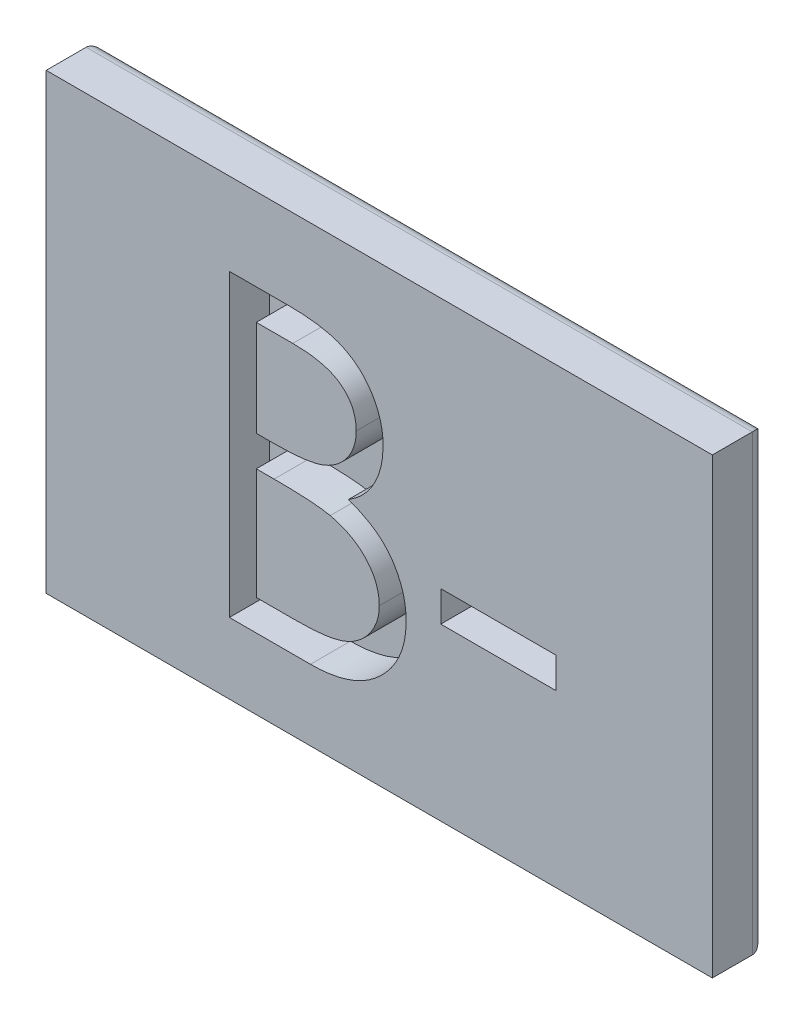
ISO-10303-21;
HEADER;
FILE_DESCRIPTION(('STEP AP214'),'2;1');
FILE_NAME('part.step','',(''),(''),'','','');
FILE_SCHEMA(('AUTOMOTIVE_DESIGN { 1 0 10303 214 1 1 1 1 }'));
ENDSEC;
DATA;
#1=APPLICATION_CONTEXT('core data for automotive mechanical design processes');
#2=APPLICATION_PROTOCOL_DEFINITION('international standard','automotive_design',2000,#1);
#3=PRODUCT_CONTEXT('',#1,'mechanical');
#4=PRODUCT('Part','Part','',(#3));
#5=PRODUCT_RELATED_PRODUCT_CATEGORY('part','',(#4));
#6=PRODUCT_DEFINITION_FORMATION('','',#4);
#7=PRODUCT_DEFINITION_CONTEXT('part definition',#1,'design');
#8=PRODUCT_DEFINITION('design','',#6,#7);
#9=PRODUCT_DEFINITION_SHAPE('','',#8);
#10=(LENGTH_UNIT() NAMED_UNIT(*) SI_UNIT(.MILLI.,.METRE.));
#11=(NAMED_UNIT(*) PLANE_ANGLE_UNIT() SI_UNIT($,.RADIAN.));
#12=(NAMED_UNIT(*) SI_UNIT($,.STERADIAN.) SOLID_ANGLE_UNIT());
#13=UNCERTAINTY_MEASURE_WITH_UNIT(LENGTH_MEASURE(1.E-05),#10,'distance_accuracy_value','');
#14=(GEOMETRIC_REPRESENTATION_CONTEXT(3) GLOBAL_UNCERTAINTY_ASSIGNED_CONTEXT((#13)) GLOBAL_UNIT_ASSIGNED_CONTEXT((#10,
#11,#12)) REPRESENTATION_CONTEXT('',''));
#15=CARTESIAN_POINT('',(0.,0.,0.));
#16=DIRECTION('',(0.,0.,1.));
#17=DIRECTION('',(1.,0.,0.));
#18=AXIS2_PLACEMENT_3D('',#15,#16,#17);
#19=CARTESIAN_POINT('',(0.,0.,2.54));
#20=DIRECTION('',(0.,0.,-1.));
#21=DIRECTION('',(-1.,0.,0.));
#22=AXIS2_PLACEMENT_3D('',#19,#20,#21);
#23=PLANE('',#22);
#24=DIRECTION('',(0.,1.,0.));
#25=VECTOR('',#24,1.);
#26=CARTESIAN_POINT('',(2.93076923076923,-2.66023079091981,2.54));
#27=LINE('',#26,#25);
#28=CARTESIAN_POINT('',(2.93076923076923,-2.66023079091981,2.54));
#29=VERTEX_POINT('',#28);
#30=CARTESIAN_POINT('',(2.93076923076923,-1.1948461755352,2.54));
#31=VERTEX_POINT('',#30);
#32=EDGE_CURVE('E567',#29,#31,#27,.T.);
#33=ORIENTED_EDGE('',*,*,#32,.T.);
#34=DIRECTION('',(1.,0.,0.));
#35=VECTOR('',#34,1.);
#36=CARTESIAN_POINT('',(2.93076923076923,-1.1948461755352,2.54));
#37=LINE('',#36,#35);
#38=CARTESIAN_POINT('',(8.42596153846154,-1.1948461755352,2.54));
#39=VERTEX_POINT('',#38);
#40=EDGE_CURVE('E563',#31,#39,#37,.T.);
#41=ORIENTED_EDGE('',*,*,#40,.T.);
#42=DIRECTION('',(0.,-1.,0.));
#43=VECTOR('',#42,1.);
#44=CARTESIAN_POINT('',(8.42596153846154,-1.1948461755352,2.54));
#45=LINE('',#44,#43);
#46=CARTESIAN_POINT('',(8.42596153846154,-2.66023079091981,2.54));
#47=VERTEX_POINT('',#46);
#48=EDGE_CURVE('E559',#39,#47,#45,.T.);
#49=ORIENTED_EDGE('',*,*,#48,.T.);
#50=DIRECTION('',(-1.,0.,0.));
#51=VECTOR('',#50,1.);
#52=CARTESIAN_POINT('',(8.42596153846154,-2.66023079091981,2.54));
#53=LINE('',#52,#51);
#54=EDGE_CURVE('E554',#47,#29,#53,.T.);
#55=ORIENTED_EDGE('',*,*,#54,.T.);
#56=EDGE_LOOP('',(#33,#41,#49,#55));
#57=FACE_BOUND('',#56,.T.);
#58=DIRECTION('',(0.,1.,0.));
#59=VECTOR('',#58,1.);
#60=CARTESIAN_POINT('',(15.875,-10.795,2.54));
#61=LINE('',#60,#59);
#62=CARTESIAN_POINT('',(15.875,-10.795,2.54));
#63=VERTEX_POINT('',#62);
#64=CARTESIAN_POINT('',(15.875,10.795,2.54));
#65=VERTEX_POINT('',#64);
#66=EDGE_CURVE('E475',#63,#65,#61,.T.);
#67=ORIENTED_EDGE('',*,*,#66,.T.);
#68=DIRECTION('',(-1.,0.,0.));
#69=VECTOR('',#68,1.);
#70=CARTESIAN_POINT('',(-15.875,10.795,2.54));
#71=LINE('',#70,#69);
#72=CARTESIAN_POINT('',(-15.875,10.795,2.54));
#73=VERTEX_POINT('',#72);
#74=EDGE_CURVE('E480',#65,#73,#71,.T.);
#75=ORIENTED_EDGE('',*,*,#74,.T.);
#76=DIRECTION('',(0.,-1.,0.));
#77=VECTOR('',#76,1.);
#78=CARTESIAN_POINT('',(-15.875,-10.795,2.54));
#79=LINE('',#78,#77);
#80=CARTESIAN_POINT('',(-15.875,-10.795,2.54));
#81=VERTEX_POINT('',#80);
#82=EDGE_CURVE('E533',#73,#81,#79,.T.);
#83=ORIENTED_EDGE('',*,*,#82,.T.);
#84=DIRECTION('',(1.,0.,0.));
#85=VECTOR('',#84,1.);
#86=CARTESIAN_POINT('',(-15.875,-10.795,2.54));
#87=LINE('',#86,#85);
#88=EDGE_CURVE('E530',#81,#63,#87,.T.);
#89=ORIENTED_EDGE('',*,*,#88,.T.);
#90=EDGE_LOOP('',(#67,#75,#83,#89));
#91=FACE_BOUND('',#90,.T.);
#92=DIRECTION('',(0.,1.,0.));
#93=VECTOR('',#92,1.);
#94=CARTESIAN_POINT('',(-7.14375,-7.42273079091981,2.54));
#95=LINE('',#94,#93);
#96=CARTESIAN_POINT('',(-7.14375,-7.42273079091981,2.54));
#97=VERTEX_POINT('',#96);
#98=CARTESIAN_POINT('',(-7.14375,6.86476920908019,2.54));
#99=VERTEX_POINT('',#98);
#100=EDGE_CURVE('E56',#97,#99,#95,.T.);
#101=ORIENTED_EDGE('',*,*,#100,.T.);
#102=DIRECTION('',(1.,0.,0.));
#103=VECTOR('',#102,1.);
#104=CARTESIAN_POINT('',(-7.14375,6.86476920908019,2.54));
#105=LINE('',#104,#103);
#106=CARTESIAN_POINT('',(-4.35608473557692,6.86476920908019,2.54));
#107=VERTEX_POINT('',#106);
#108=EDGE_CURVE('E639',#99,#107,#105,.T.);
#109=ORIENTED_EDGE('',*,*,#108,.T.);
#110=CARTESIAN_POINT('',(-4.35608473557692,6.86476920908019,2.54));
#111=CARTESIAN_POINT('',(-4.21962491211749,6.86405177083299,2.54));
#112=CARTESIAN_POINT('',(-3.95513181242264,6.86266119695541,2.54));
#113=CARTESIAN_POINT('',(-3.57051459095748,6.84109470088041,2.54));
#114=CARTESIAN_POINT('',(-3.21027033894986,6.81168829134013,2.54));
#115=CARTESIAN_POINT('',(-2.87429458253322,6.7650290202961,2.54));
#116=CARTESIAN_POINT('',(-2.56274257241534,6.70872901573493,2.54));
#117=CARTESIAN_POINT('',(-2.27467539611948,6.6405498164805,2.54));
#118=CARTESIAN_POINT('',(-2.01100908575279,6.55879831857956,2.54));
#119=CARTESIAN_POINT('',(-1.69622387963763,6.42879724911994,2.54));
#120=CARTESIAN_POINT('',(-1.33731918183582,6.23561731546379,2.54));
#121=CARTESIAN_POINT('',(-0.948705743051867,5.95015892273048,2.54));
#122=CARTESIAN_POINT('',(-0.616402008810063,5.60100318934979,2.54));
#123=CARTESIAN_POINT('',(-0.329891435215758,5.20714720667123,2.54));
#124=CARTESIAN_POINT('',(-0.102103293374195,4.77388582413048,2.54));
#125=CARTESIAN_POINT('',(0.0626899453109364,4.31154563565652,2.54));
#126=CARTESIAN_POINT('',(0.167020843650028,3.82609009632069,2.54));
#127=CARTESIAN_POINT('',(0.177750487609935,3.49281098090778,2.54));
#128=CARTESIAN_POINT('',(0.183173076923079,3.32437708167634,2.54));
#129=B_SPLINE_CURVE_WITH_KNOTS('',3,(#110,#111,#112,#113,#114,#115,#116,#117,#118,#119,#120,
#121,#122,#123,#124,#125,#126,#127,#128),.UNSPECIFIED.,.F.,.F.,(4,1,1,1,1,1,1,1,1,1,1,1,1,1,1,1,
4),(0.,0.0625940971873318,0.12132293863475,0.176680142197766,0.228365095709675,
0.276868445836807,0.321879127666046,0.364098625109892,0.403355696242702,0.477967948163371,
0.550535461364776,0.623584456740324,0.698174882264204,0.773353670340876,0.847281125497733,
0.922818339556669,1.),.UNSPECIFIED.);
#130=CARTESIAN_POINT('',(0.183173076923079,3.32437708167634,2.54));
#131=VERTEX_POINT('',#130);
#132=EDGE_CURVE('E630',#107,#131,#129,.T.);
#133=ORIENTED_EDGE('',*,*,#132,.T.);
#134=CARTESIAN_POINT('',(0.183173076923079,3.32437708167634,2.54));
#135=CARTESIAN_POINT('',(0.178710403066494,3.16659182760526,2.54));
#136=CARTESIAN_POINT('',(0.169940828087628,2.85652892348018,2.54));
#137=CARTESIAN_POINT('',(0.086082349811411,2.40302689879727,2.54));
#138=CARTESIAN_POINT('',(-0.0452020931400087,1.97133531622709,2.54));
#139=CARTESIAN_POINT('',(-0.227695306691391,1.5630296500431,2.54));
#140=CARTESIAN_POINT('',(-0.464875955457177,1.18733529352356,2.54));
#141=CARTESIAN_POINT('',(-0.745965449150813,0.841221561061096,2.54));
#142=CARTESIAN_POINT('',(-1.08509682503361,0.539342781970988,2.54));
#143=CARTESIAN_POINT('',(-1.33918262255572,0.37057514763,2.54));
#144=CARTESIAN_POINT('',(-1.46824669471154,0.284848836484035,2.54));
#145=B_SPLINE_CURVE_WITH_KNOTS('',3,(#134,#135,#136,#137,#138,#139,#140,#141,#142,#143,#144),
.UNSPECIFIED.,.F.,.F.,(4,1,1,1,1,1,1,1,4),(0.,0.13056910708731,0.256580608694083,
0.380551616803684,0.503622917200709,0.625739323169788,0.747548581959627,0.871766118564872,1.),.UNSPECIFIED.);
#146=CARTESIAN_POINT('',(-1.46824669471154,0.284848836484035,2.54));
#147=VERTEX_POINT('',#146);
#148=EDGE_CURVE('E621',#131,#147,#145,.T.);
#149=ORIENTED_EDGE('',*,*,#148,.T.);
#150=CARTESIAN_POINT('',(-1.46824669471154,0.284848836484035,2.54));
#151=CARTESIAN_POINT('',(-1.30593894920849,0.222534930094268,2.54));
#152=CARTESIAN_POINT('',(-0.995404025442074,0.10331299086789,2.54));
#153=CARTESIAN_POINT('',(-0.568060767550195,-0.107470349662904,2.54));
#154=CARTESIAN_POINT('',(-0.199872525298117,-0.336732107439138,2.54));
#155=CARTESIAN_POINT('',(0.111991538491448,-0.587097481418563,2.54));
#156=CARTESIAN_POINT('',(0.378709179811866,-0.856963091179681,2.54));
#157=CARTESIAN_POINT('',(0.611607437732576,-1.15028593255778,2.54));
#158=CARTESIAN_POINT('',(0.810331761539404,-1.47089236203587,2.54));
#159=CARTESIAN_POINT('',(0.980609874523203,-1.81543965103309,2.54));
#160=CARTESIAN_POINT('',(1.11347854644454,-2.18040962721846,2.54));
#161=CARTESIAN_POINT('',(1.21298447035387,-2.56237890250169,2.54));
#162=CARTESIAN_POINT('',(1.27000159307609,-2.95997780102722,2.54));
#163=CARTESIAN_POINT('',(1.27811542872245,-3.23056418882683,2.54));
#164=CARTESIAN_POINT('',(1.28221153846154,-3.36716438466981,2.54));
#165=B_SPLINE_CURVE_WITH_KNOTS('',3,(#150,#151,#152,#153,#154,#155,#156,#157,#158,#159,#160,
#161,#162,#163,#164),.UNSPECIFIED.,.F.,.F.,(4,1,1,1,1,1,1,1,1,1,1,1,4),(0.,0.106057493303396,
0.20291425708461,0.290300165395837,0.37022256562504,0.44638372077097,0.521396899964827,
0.598291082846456,0.676142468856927,0.755528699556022,0.834887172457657,0.916646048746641,1.),.UNSPECIFIED.);
#166=CARTESIAN_POINT('',(1.28221153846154,-3.36716438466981,2.54));
#167=VERTEX_POINT('',#166);
#168=EDGE_CURVE('E612',#147,#167,#165,.T.);
#169=ORIENTED_EDGE('',*,*,#168,.T.);
#170=CARTESIAN_POINT('',(1.28221153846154,-3.36716438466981,2.54));
#171=CARTESIAN_POINT('',(1.27822391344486,-3.50663843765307,2.54));
#172=CARTESIAN_POINT('',(1.2703781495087,-3.78105754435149,2.54));
#173=CARTESIAN_POINT('',(1.21249347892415,-4.184190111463,2.54));
#174=CARTESIAN_POINT('',(1.11448487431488,-4.56944212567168,2.54));
#175=CARTESIAN_POINT('',(0.979483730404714,-4.93930542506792,2.54));
#176=CARTESIAN_POINT('',(0.803288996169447,-5.29306447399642,2.54));
#177=CARTESIAN_POINT('',(0.58886234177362,-5.63112004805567,2.54));
#178=CARTESIAN_POINT('',(0.333191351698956,-5.95007554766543,2.54));
#179=CARTESIAN_POINT('',(0.0471847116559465,-6.25347519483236,2.54));
#180=CARTESIAN_POINT('',(-0.276374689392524,-6.52627576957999,2.54));
#181=CARTESIAN_POINT('',(-0.625462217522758,-6.76922738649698,2.54));
#182=CARTESIAN_POINT('',(-1.00447415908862,-6.96903220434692,2.54));
#183=CARTESIAN_POINT('',(-1.40718569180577,-7.1368736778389,2.54));
#184=CARTESIAN_POINT('',(-1.83811431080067,-7.26508234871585,2.54));
#185=CARTESIAN_POINT('',(-2.2953249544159,-7.35477753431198,2.54));
#186=CARTESIAN_POINT('',(-2.77842330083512,-7.41521381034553,2.54));
#187=CARTESIAN_POINT('',(-3.10993310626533,-7.42018261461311,2.54));
#188=CARTESIAN_POINT('',(-3.27994290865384,-7.42273079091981,2.54));
#189=B_SPLINE_CURVE_WITH_KNOTS('',3,(#170,#171,#172,#173,#174,#175,#176,#177,#178,#179,#180,
#181,#182,#183,#184,#185,#186,#187,#188),.UNSPECIFIED.,.F.,.F.,(4,1,1,1,1,1,1,1,1,1,1,1,1,1,1,1,
4),(0.,0.0611602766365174,0.120334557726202,0.178180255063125,0.235235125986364,
0.29268296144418,0.35118624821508,0.410456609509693,0.471719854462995,0.533761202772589,
0.595739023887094,0.657887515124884,0.721295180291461,0.786822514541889,0.854686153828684,
0.925477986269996,1.),.UNSPECIFIED.);
#190=CARTESIAN_POINT('',(-3.27994290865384,-7.42273079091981,2.54));
#191=VERTEX_POINT('',#190);
#192=EDGE_CURVE('E606',#167,#191,#189,.T.);
#193=ORIENTED_EDGE('',*,*,#192,.T.);
#194=DIRECTION('',(-1.,0.,0.));
#195=VECTOR('',#194,1.);
#196=CARTESIAN_POINT('',(-3.27994290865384,-7.42273079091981,2.54));
#197=LINE('',#196,#195);
#198=EDGE_CURVE('E375',#191,#97,#197,.T.);
#199=ORIENTED_EDGE('',*,*,#198,.T.);
#200=EDGE_LOOP('',(#101,#109,#133,#149,#169,#193,#199));
#201=FACE_BOUND('',#200,.T.);
#202=ADVANCED_FACE('F38',(#57,#91,#201),#23,.F.);
#203=CARTESIAN_POINT('',(15.875,-10.795,2.54));
#204=DIRECTION('',(-1.,0.,0.));
#205=DIRECTION('',(0.,0.,1.));
#206=AXIS2_PLACEMENT_3D('',#203,#204,#205);
#207=PLANE('',#206);
#208=DIRECTION('',(0.,0.,-1.));
#209=VECTOR('',#208,1.);
#210=CARTESIAN_POINT('',(15.875,-10.795,2.54));
#211=LINE('',#210,#209);
#212=CARTESIAN_POINT('',(15.875,-10.795,0.635));
#213=VERTEX_POINT('',#212);
#214=EDGE_CURVE('E526',#63,#213,#211,.T.);
#215=ORIENTED_EDGE('',*,*,#214,.T.);
#216=DIRECTION('',(0.,1.,0.));
#217=VECTOR('',#216,1.);
#218=CARTESIAN_POINT('',(15.875,10.795,0.635));
#219=LINE('',#218,#217);
#220=CARTESIAN_POINT('',(15.875,10.795,0.635));
#221=VERTEX_POINT('',#220);
#222=EDGE_CURVE('E11',#213,#221,#219,.T.);
#223=ORIENTED_EDGE('',*,*,#222,.T.);
#224=DIRECTION('',(0.,0.,-1.));
#225=VECTOR('',#224,1.);
#226=CARTESIAN_POINT('',(15.875,10.795,2.54));
#227=LINE('',#226,#225);
#228=EDGE_CURVE('E514',#65,#221,#227,.T.);
#229=ORIENTED_EDGE('',*,*,#228,.F.);
#230=ORIENTED_EDGE('',*,*,#66,.F.);
#231=EDGE_LOOP('',(#215,#223,#229,#230));
#232=FACE_BOUND('',#231,.T.);
#233=ADVANCED_FACE('F430',(#232),#207,.F.);
#234=CARTESIAN_POINT('',(-15.875,10.795,2.54));
#235=DIRECTION('',(0.,-1.,0.));
#236=DIRECTION('',(0.,0.,-1.));
#237=AXIS2_PLACEMENT_3D('',#234,#235,#236);
#238=PLANE('',#237);
#239=ORIENTED_EDGE('',*,*,#228,.T.);
#240=DIRECTION('',(-1.,0.,0.));
#241=VECTOR('',#240,1.);
#242=CARTESIAN_POINT('',(-15.875,10.795,0.635));
#243=LINE('',#242,#241);
#244=CARTESIAN_POINT('',(-15.875,10.795,0.635));
#245=VERTEX_POINT('',#244);
#246=EDGE_CURVE('E48',#221,#245,#243,.T.);
#247=ORIENTED_EDGE('',*,*,#246,.T.);
#248=DIRECTION('',(0.,0.,-1.));
#249=VECTOR('',#248,1.);
#250=CARTESIAN_POINT('',(-15.875,10.795,2.54));
#251=LINE('',#250,#249);
#252=EDGE_CURVE('E518',#73,#245,#251,.T.);
#253=ORIENTED_EDGE('',*,*,#252,.F.);
#254=ORIENTED_EDGE('',*,*,#74,.F.);
#255=EDGE_LOOP('',(#239,#247,#253,#254));
#256=FACE_BOUND('',#255,.T.);
#257=ADVANCED_FACE('F444',(#256),#238,.F.);
#258=CARTESIAN_POINT('',(-15.875,-10.795,2.54));
#259=DIRECTION('',(1.,0.,0.));
#260=DIRECTION('',(0.,0.,-1.));
#261=AXIS2_PLACEMENT_3D('',#258,#259,#260);
#262=PLANE('',#261);
#263=ORIENTED_EDGE('',*,*,#252,.T.);
#264=DIRECTION('',(0.,-1.,0.));
#265=VECTOR('',#264,1.);
#266=CARTESIAN_POINT('',(-15.875,-10.795,0.635));
#267=LINE('',#266,#265);
#268=CARTESIAN_POINT('',(-15.875,-10.795,0.635));
#269=VERTEX_POINT('',#268);
#270=EDGE_CURVE('E510',#245,#269,#267,.T.);
#271=ORIENTED_EDGE('',*,*,#270,.T.);
#272=DIRECTION('',(0.,0.,-1.));
#273=VECTOR('',#272,1.);
#274=CARTESIAN_POINT('',(-15.875,-10.795,2.54));
#275=LINE('',#274,#273);
#276=EDGE_CURVE('E522',#81,#269,#275,.T.);
#277=ORIENTED_EDGE('',*,*,#276,.F.);
#278=ORIENTED_EDGE('',*,*,#82,.F.);
#279=EDGE_LOOP('',(#263,#271,#277,#278));
#280=FACE_BOUND('',#279,.T.);
#281=ADVANCED_FACE('F440',(#280),#262,.F.);
#282=CARTESIAN_POINT('',(-15.875,-10.795,2.54));
#283=DIRECTION('',(0.,1.,0.));
#284=DIRECTION('',(0.,0.,1.));
#285=AXIS2_PLACEMENT_3D('',#282,#283,#284);
#286=PLANE('',#285);
#287=ORIENTED_EDGE('',*,*,#276,.T.);
#288=DIRECTION('',(1.,0.,0.));
#289=VECTOR('',#288,1.);
#290=CARTESIAN_POINT('',(15.875,-10.795,0.635));
#291=LINE('',#290,#289);
#292=EDGE_CURVE('E496',#269,#213,#291,.T.);
#293=ORIENTED_EDGE('',*,*,#292,.T.);
#294=ORIENTED_EDGE('',*,*,#214,.F.);
#295=ORIENTED_EDGE('',*,*,#88,.F.);
#296=EDGE_LOOP('',(#287,#293,#294,#295));
#297=FACE_BOUND('',#296,.T.);
#298=ADVANCED_FACE('F436',(#297),#286,.F.);
#299=CARTESIAN_POINT('',(0.,0.,0.));
#300=DIRECTION('',(0.,0.,-1.));
#301=DIRECTION('',(-1.,0.,0.));
#302=AXIS2_PLACEMENT_3D('',#299,#300,#301);
#303=PLANE('',#302);
#304=DIRECTION('',(1.,0.,0.));
#305=VECTOR('',#304,1.);
#306=CARTESIAN_POINT('',(-15.875,-10.16,0.));
#307=LINE('',#306,#305);
#308=CARTESIAN_POINT('',(15.24,-10.16,0.));
#309=VERTEX_POINT('',#308);
#310=CARTESIAN_POINT('',(-15.24,-10.16,0.));
#311=VERTEX_POINT('',#310);
#312=EDGE_CURVE('E502',#309,#311,#307,.F.);
#313=ORIENTED_EDGE('',*,*,#312,.T.);
#314=DIRECTION('',(0.,-1.,0.));
#315=VECTOR('',#314,1.);
#316=CARTESIAN_POINT('',(-15.24,10.795,0.));
#317=LINE('',#316,#315);
#318=CARTESIAN_POINT('',(-15.24,10.16,0.));
#319=VERTEX_POINT('',#318);
#320=EDGE_CURVE('E499',#311,#319,#317,.F.);
#321=ORIENTED_EDGE('',*,*,#320,.T.);
#322=DIRECTION('',(-1.,0.,0.));
#323=VECTOR('',#322,1.);
#324=CARTESIAN_POINT('',(15.875,10.16,0.));
#325=LINE('',#324,#323);
#326=CARTESIAN_POINT('',(15.24,10.16,0.));
#327=VERTEX_POINT('',#326);
#328=EDGE_CURVE('E470',#319,#327,#325,.F.);
#329=ORIENTED_EDGE('',*,*,#328,.T.);
#330=DIRECTION('',(0.,1.,0.));
#331=VECTOR('',#330,1.);
#332=CARTESIAN_POINT('',(15.24,-10.795,0.));
#333=LINE('',#332,#331);
#334=EDGE_CURVE('E507',#327,#309,#333,.F.);
#335=ORIENTED_EDGE('',*,*,#334,.T.);
#336=EDGE_LOOP('',(#313,#321,#329,#335));
#337=FACE_BOUND('',#336,.T.);
#338=ADVANCED_FACE('F433',(#337),#303,.T.);
#339=CARTESIAN_POINT('',(15.24,-10.795,0.635));
#340=DIRECTION('',(0.,-1.,0.));
#341=DIRECTION('',(0.,0.,-1.));
#342=AXIS2_PLACEMENT_3D('',#339,#340,#341);
#343=CYLINDRICAL_SURFACE('',#342,0.635);
#344=CARTESIAN_POINT('',(15.24,-10.16,0.635));
#345=DIRECTION('',(-0.707106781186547,-0.707106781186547,0.));
#346=DIRECTION('',(0.707106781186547,-0.707106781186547,0.));
#347=AXIS2_PLACEMENT_3D('',#344,#345,#346);
#348=ELLIPSE('',#347,0.898025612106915,0.635);
#349=EDGE_CURVE('E476',#309,#213,#348,.T.);
#350=ORIENTED_EDGE('',*,*,#349,.F.);
#351=ORIENTED_EDGE('',*,*,#334,.F.);
#352=CARTESIAN_POINT('',(15.24,10.16,0.635));
#353=DIRECTION('',(0.707106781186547,-0.707106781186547,0.));
#354=DIRECTION('',(-0.707106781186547,-0.707106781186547,0.));
#355=AXIS2_PLACEMENT_3D('',#352,#353,#354);
#356=ELLIPSE('',#355,0.898025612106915,0.635);
#357=EDGE_CURVE('E42',#221,#327,#356,.F.);
#358=ORIENTED_EDGE('',*,*,#357,.F.);
#359=ORIENTED_EDGE('',*,*,#222,.F.);
#360=EDGE_LOOP('',(#350,#351,#358,#359));
#361=FACE_BOUND('',#360,.T.);
#362=ADVANCED_FACE('F40',(#361),#343,.T.);
#363=CARTESIAN_POINT('',(-15.875,10.16,0.635));
#364=DIRECTION('',(1.,0.,0.));
#365=DIRECTION('',(0.,0.,-1.));
#366=AXIS2_PLACEMENT_3D('',#363,#364,#365);
#367=CYLINDRICAL_SURFACE('',#366,0.635);
#368=ORIENTED_EDGE('',*,*,#357,.T.);
#369=ORIENTED_EDGE('',*,*,#328,.F.);
#370=CARTESIAN_POINT('',(-15.24,10.16,0.635));
#371=DIRECTION('',(0.707106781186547,0.707106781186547,0.));
#372=DIRECTION('',(0.707106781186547,-0.707106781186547,0.));
#373=AXIS2_PLACEMENT_3D('',#370,#371,#372);
#374=ELLIPSE('',#373,0.898025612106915,0.635);
#375=EDGE_CURVE('E483',#245,#319,#374,.F.);
#376=ORIENTED_EDGE('',*,*,#375,.F.);
#377=ORIENTED_EDGE('',*,*,#246,.F.);
#378=EDGE_LOOP('',(#368,#369,#376,#377));
#379=FACE_BOUND('',#378,.T.);
#380=ADVANCED_FACE('F457',(#379),#367,.T.);
#381=CARTESIAN_POINT('',(-15.875,-10.16,0.635));
#382=DIRECTION('',(-1.,0.,0.));
#383=DIRECTION('',(0.,0.,1.));
#384=AXIS2_PLACEMENT_3D('',#381,#382,#383);
#385=CYLINDRICAL_SURFACE('',#384,0.635);
#386=ORIENTED_EDGE('',*,*,#349,.T.);
#387=ORIENTED_EDGE('',*,*,#292,.F.);
#388=CARTESIAN_POINT('',(-15.24,-10.16,0.635));
#389=DIRECTION('',(-0.707106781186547,0.707106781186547,0.));
#390=DIRECTION('',(-0.707106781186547,-0.707106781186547,0.));
#391=AXIS2_PLACEMENT_3D('',#388,#389,#390);
#392=ELLIPSE('',#391,0.898025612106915,0.635);
#393=EDGE_CURVE('E488',#311,#269,#392,.T.);
#394=ORIENTED_EDGE('',*,*,#393,.F.);
#395=ORIENTED_EDGE('',*,*,#312,.F.);
#396=EDGE_LOOP('',(#386,#387,#394,#395));
#397=FACE_BOUND('',#396,.T.);
#398=ADVANCED_FACE('F454',(#397),#385,.T.);
#399=CARTESIAN_POINT('',(-15.24,-10.795,0.635));
#400=DIRECTION('',(0.,1.,0.));
#401=DIRECTION('',(0.,0.,1.));
#402=AXIS2_PLACEMENT_3D('',#399,#400,#401);
#403=CYLINDRICAL_SURFACE('',#402,0.635);
#404=ORIENTED_EDGE('',*,*,#375,.T.);
#405=ORIENTED_EDGE('',*,*,#320,.F.);
#406=ORIENTED_EDGE('',*,*,#393,.T.);
#407=ORIENTED_EDGE('',*,*,#270,.F.);
#408=EDGE_LOOP('',(#404,#405,#406,#407));
#409=FACE_BOUND('',#408,.T.);
#410=ADVANCED_FACE('F426',(#409),#403,.T.);
#411=CARTESIAN_POINT('',(2.93076923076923,-2.66023079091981,0.635));
#412=DIRECTION('',(1.,0.,0.));
#413=DIRECTION('',(0.,0.,-1.));
#414=AXIS2_PLACEMENT_3D('',#411,#412,#413);
#415=PLANE('',#414);
#416=ORIENTED_EDGE('',*,*,#32,.F.);
#417=DIRECTION('',(0.,0.,1.));
#418=VECTOR('',#417,1.);
#419=CARTESIAN_POINT('',(2.93076923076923,-2.66023079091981,0.635));
#420=LINE('',#419,#418);
#421=CARTESIAN_POINT('',(2.93076923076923,-2.66023079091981,0.635));
#422=VERTEX_POINT('',#421);
#423=EDGE_CURVE('E549',#422,#29,#420,.T.);
#424=ORIENTED_EDGE('',*,*,#423,.F.);
#425=DIRECTION('',(0.,1.,0.));
#426=VECTOR('',#425,1.);
#427=CARTESIAN_POINT('',(2.93076923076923,-2.66023079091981,0.635));
#428=LINE('',#427,#426);
#429=CARTESIAN_POINT('',(2.93076923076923,-1.1948461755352,0.635));
#430=VERTEX_POINT('',#429);
#431=EDGE_CURVE('E558',#422,#430,#428,.T.);
#432=ORIENTED_EDGE('',*,*,#431,.T.);
#433=DIRECTION('',(0.,0.,1.));
#434=VECTOR('',#433,1.);
#435=CARTESIAN_POINT('',(2.93076923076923,-1.1948461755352,0.635));
#436=LINE('',#435,#434);
#437=EDGE_CURVE('E538',#430,#31,#436,.T.);
#438=ORIENTED_EDGE('',*,*,#437,.T.);
#439=EDGE_LOOP('',(#416,#424,#432,#438));
#440=FACE_BOUND('',#439,.T.);
#441=ADVANCED_FACE('F422',(#440),#415,.T.);
#442=CARTESIAN_POINT('',(2.93076923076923,-1.1948461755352,0.635));
#443=DIRECTION('',(0.,-1.,0.));
#444=DIRECTION('',(0.,0.,-1.));
#445=AXIS2_PLACEMENT_3D('',#442,#443,#444);
#446=PLANE('',#445);
#447=ORIENTED_EDGE('',*,*,#40,.F.);
#448=ORIENTED_EDGE('',*,*,#437,.F.);
#449=DIRECTION('',(1.,0.,0.));
#450=VECTOR('',#449,1.);
#451=CARTESIAN_POINT('',(2.93076923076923,-1.1948461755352,0.635));
#452=LINE('',#451,#450);
#453=CARTESIAN_POINT('',(8.42596153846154,-1.1948461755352,0.635));
#454=VERTEX_POINT('',#453);
#455=EDGE_CURVE('E576',#430,#454,#452,.T.);
#456=ORIENTED_EDGE('',*,*,#455,.T.);
#457=DIRECTION('',(0.,0.,1.));
#458=VECTOR('',#457,1.);
#459=CARTESIAN_POINT('',(8.42596153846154,-1.1948461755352,0.635));
#460=LINE('',#459,#458);
#461=EDGE_CURVE('E543',#454,#39,#460,.T.);
#462=ORIENTED_EDGE('',*,*,#461,.T.);
#463=EDGE_LOOP('',(#447,#448,#456,#462));
#464=FACE_BOUND('',#463,.T.);
#465=ADVANCED_FACE('F418',(#464),#446,.T.);
#466=CARTESIAN_POINT('',(8.42596153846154,-1.1948461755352,0.635));
#467=DIRECTION('',(-1.,0.,0.));
#468=DIRECTION('',(0.,0.,1.));
#469=AXIS2_PLACEMENT_3D('',#466,#467,#468);
#470=PLANE('',#469);
#471=ORIENTED_EDGE('',*,*,#48,.F.);
#472=ORIENTED_EDGE('',*,*,#461,.F.);
#473=DIRECTION('',(0.,-1.,0.));
#474=VECTOR('',#473,1.);
#475=CARTESIAN_POINT('',(8.42596153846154,-1.1948461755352,0.635));
#476=LINE('',#475,#474);
#477=CARTESIAN_POINT('',(8.42596153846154,-2.66023079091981,0.635));
#478=VERTEX_POINT('',#477);
#479=EDGE_CURVE('E573',#454,#478,#476,.T.);
#480=ORIENTED_EDGE('',*,*,#479,.T.);
#481=DIRECTION('',(0.,0.,1.));
#482=VECTOR('',#481,1.);
#483=CARTESIAN_POINT('',(8.42596153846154,-2.66023079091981,0.635));
#484=LINE('',#483,#482);
#485=EDGE_CURVE('E546',#478,#47,#484,.T.);
#486=ORIENTED_EDGE('',*,*,#485,.T.);
#487=EDGE_LOOP('',(#471,#472,#480,#486));
#488=FACE_BOUND('',#487,.T.);
#489=ADVANCED_FACE('F414',(#488),#470,.T.);
#490=CARTESIAN_POINT('',(8.42596153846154,-2.66023079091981,0.635));
#491=DIRECTION('',(0.,1.,0.));
#492=DIRECTION('',(0.,0.,1.));
#493=AXIS2_PLACEMENT_3D('',#490,#491,#492);
#494=PLANE('',#493);
#495=ORIENTED_EDGE('',*,*,#54,.F.);
#496=ORIENTED_EDGE('',*,*,#485,.F.);
#497=DIRECTION('',(-1.,0.,0.));
#498=VECTOR('',#497,1.);
#499=CARTESIAN_POINT('',(8.42596153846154,-2.66023079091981,0.635));
#500=LINE('',#499,#498);
#501=EDGE_CURVE('E553',#478,#422,#500,.T.);
#502=ORIENTED_EDGE('',*,*,#501,.T.);
#503=ORIENTED_EDGE('',*,*,#423,.T.);
#504=EDGE_LOOP('',(#495,#496,#502,#503));
#505=FACE_BOUND('',#504,.T.);
#506=ADVANCED_FACE('F410',(#505),#494,.T.);
#507=CARTESIAN_POINT('',(0.,0.,0.635));
#508=DIRECTION('',(0.,0.,-1.));
#509=DIRECTION('',(-1.,0.,0.));
#510=AXIS2_PLACEMENT_3D('',#507,#508,#509);
#511=PLANE('',#510);
#512=ORIENTED_EDGE('',*,*,#431,.F.);
#513=ORIENTED_EDGE('',*,*,#501,.F.);
#514=ORIENTED_EDGE('',*,*,#479,.F.);
#515=ORIENTED_EDGE('',*,*,#455,.F.);
#516=EDGE_LOOP('',(#512,#513,#514,#515));
#517=FACE_BOUND('',#516,.T.);
#518=ADVANCED_FACE('F407',(#517),#511,.F.);
#519=CARTESIAN_POINT('',(-7.14375,-7.42273079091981,0.635));
#520=DIRECTION('',(1.,0.,0.));
#521=DIRECTION('',(0.,0.,-1.));
#522=AXIS2_PLACEMENT_3D('',#519,#520,#521);
#523=PLANE('',#522);
#524=ORIENTED_EDGE('',*,*,#100,.F.);
#525=DIRECTION('',(0.,0.,1.));
#526=VECTOR('',#525,1.);
#527=CARTESIAN_POINT('',(-7.14375,-7.42273079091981,0.635));
#528=LINE('',#527,#526);
#529=CARTESIAN_POINT('',(-7.14375,-7.42273079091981,0.635));
#530=VERTEX_POINT('',#529);
#531=EDGE_CURVE('E599',#530,#97,#528,.T.);
#532=ORIENTED_EDGE('',*,*,#531,.F.);
#533=DIRECTION('',(0.,1.,0.));
#534=VECTOR('',#533,1.);
#535=CARTESIAN_POINT('',(-7.14375,-7.42273079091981,0.635));
#536=LINE('',#535,#534);
#537=CARTESIAN_POINT('',(-7.14375,6.86476920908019,0.635));
#538=VERTEX_POINT('',#537);
#539=EDGE_CURVE('E370',#530,#538,#536,.T.);
#540=ORIENTED_EDGE('',*,*,#539,.T.);
#541=DIRECTION('',(0.,0.,1.));
#542=VECTOR('',#541,1.);
#543=CARTESIAN_POINT('',(-7.14375,6.86476920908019,0.635));
#544=LINE('',#543,#542);
#545=EDGE_CURVE('E492',#538,#99,#544,.T.);
#546=ORIENTED_EDGE('',*,*,#545,.T.);
#547=EDGE_LOOP('',(#524,#532,#540,#546));
#548=FACE_BOUND('',#547,.T.);
#549=ADVANCED_FACE('F403',(#548),#523,.T.);
#550=CARTESIAN_POINT('',(-7.14375,6.86476920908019,0.635));
#551=DIRECTION('',(0.,-1.,0.));
#552=DIRECTION('',(0.,0.,-1.));
#553=AXIS2_PLACEMENT_3D('',#550,#551,#552);
#554=PLANE('',#553);
#555=ORIENTED_EDGE('',*,*,#108,.F.);
#556=ORIENTED_EDGE('',*,*,#545,.F.);
#557=DIRECTION('',(1.,0.,0.));
#558=VECTOR('',#557,1.);
#559=CARTESIAN_POINT('',(-7.14375,6.86476920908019,0.635));
#560=LINE('',#559,#558);
#561=CARTESIAN_POINT('',(-4.35608473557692,6.86476920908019,0.635));
#562=VERTEX_POINT('',#561);
#563=EDGE_CURVE('E374',#538,#562,#560,.T.);
#564=ORIENTED_EDGE('',*,*,#563,.T.);
#565=DIRECTION('',(0.,0.,1.));
#566=VECTOR('',#565,1.);
#567=CARTESIAN_POINT('',(-4.35608473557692,6.86476920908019,0.635));
#568=LINE('',#567,#566);
#569=EDGE_CURVE('E584',#562,#107,#568,.T.);
#570=ORIENTED_EDGE('',*,*,#569,.T.);
#571=EDGE_LOOP('',(#555,#556,#564,#570));
#572=FACE_BOUND('',#571,.T.);
#573=ADVANCED_FACE('F398',(#572),#554,.T.);
#574=CARTESIAN_POINT('',(-4.35608473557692,6.86476920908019,0.635));
#575=CARTESIAN_POINT('',(-4.21962491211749,6.86405177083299,0.635000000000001));
#576=CARTESIAN_POINT('',(-3.95513181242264,6.86266119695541,0.635));
#577=CARTESIAN_POINT('',(-3.57051459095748,6.84109470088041,0.635000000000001));
#578=CARTESIAN_POINT('',(-3.21027033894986,6.81168829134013,0.635));
#579=CARTESIAN_POINT('',(-2.87429458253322,6.7650290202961,0.635000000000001));
#580=CARTESIAN_POINT('',(-2.56274257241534,6.70872901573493,0.634999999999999));
#581=CARTESIAN_POINT('',(-2.27467539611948,6.6405498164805,0.635000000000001));
#582=CARTESIAN_POINT('',(-2.01100908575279,6.55879831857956,0.634999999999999));
#583=CARTESIAN_POINT('',(-1.69622387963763,6.42879724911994,0.635000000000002));
#584=CARTESIAN_POINT('',(-1.33731918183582,6.23561731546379,0.635));
#585=CARTESIAN_POINT('',(-0.948705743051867,5.95015892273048,0.635000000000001));
#586=CARTESIAN_POINT('',(-0.616402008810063,5.60100318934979,0.635000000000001));
#587=CARTESIAN_POINT('',(-0.329891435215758,5.20714720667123,0.635));
#588=CARTESIAN_POINT('',(-0.102103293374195,4.77388582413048,0.635000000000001));
#589=CARTESIAN_POINT('',(0.0626899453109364,4.31154563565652,0.635));
#590=CARTESIAN_POINT('',(0.167020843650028,3.82609009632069,0.635000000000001));
#591=CARTESIAN_POINT('',(0.177750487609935,3.49281098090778,0.635));
#592=CARTESIAN_POINT('',(0.183173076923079,3.32437708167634,0.635));
#593=B_SPLINE_CURVE_WITH_KNOTS('',3,(#574,#575,#576,#577,#578,#579,#580,#581,#582,#583,#584,
#585,#586,#587,#588,#589,#590,#591,#592),.UNSPECIFIED.,.F.,.F.,(4,1,1,1,1,1,1,1,1,1,1,1,1,1,1,1,
4),(0.,0.0625940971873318,0.12132293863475,0.176680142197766,0.228365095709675,
0.276868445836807,0.321879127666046,0.364098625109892,0.403355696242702,0.477967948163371,
0.550535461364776,0.623584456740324,0.698174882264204,0.773353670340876,0.847281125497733,
0.922818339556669,1.),.UNSPECIFIED.);
#594=DIRECTION('',(0.,0.,1.));
#595=VECTOR('',#594,1.);
#596=SURFACE_OF_LINEAR_EXTRUSION('',#593,#595);
#597=ORIENTED_EDGE('',*,*,#132,.F.);
#598=ORIENTED_EDGE('',*,*,#569,.F.);
#599=CARTESIAN_POINT('',(0.183173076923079,3.32437708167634,0.635));
#600=VERTEX_POINT('',#599);
#601=EDGE_CURVE('E378',#562,#600,#593,.T.);
#602=ORIENTED_EDGE('',*,*,#601,.T.);
#603=DIRECTION('',(0.,0.,1.));
#604=VECTOR('',#603,1.);
#605=CARTESIAN_POINT('',(0.183173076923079,3.32437708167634,0.635));
#606=LINE('',#605,#604);
#607=EDGE_CURVE('E587',#600,#131,#606,.T.);
#608=ORIENTED_EDGE('',*,*,#607,.T.);
#609=EDGE_LOOP('',(#597,#598,#602,#608));
#610=FACE_BOUND('',#609,.T.);
#611=ADVANCED_FACE('F393',(#610),#596,.T.);
#612=CARTESIAN_POINT('',(0.183173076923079,3.32437708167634,0.635));
#613=CARTESIAN_POINT('',(0.178710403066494,3.16659182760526,0.635));
#614=CARTESIAN_POINT('',(0.169940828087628,2.85652892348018,0.635));
#615=CARTESIAN_POINT('',(0.086082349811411,2.40302689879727,0.635000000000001));
#616=CARTESIAN_POINT('',(-0.0452020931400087,1.97133531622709,0.635));
#617=CARTESIAN_POINT('',(-0.227695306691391,1.5630296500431,0.635));
#618=CARTESIAN_POINT('',(-0.464875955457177,1.18733529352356,0.635));
#619=CARTESIAN_POINT('',(-0.745965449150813,0.841221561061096,0.635000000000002));
#620=CARTESIAN_POINT('',(-1.08509682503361,0.539342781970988,0.634999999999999));
#621=CARTESIAN_POINT('',(-1.33918262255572,0.37057514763,0.635));
#622=CARTESIAN_POINT('',(-1.46824669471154,0.284848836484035,0.635));
#623=B_SPLINE_CURVE_WITH_KNOTS('',3,(#612,#613,#614,#615,#616,#617,#618,#619,#620,#621,#622),
.UNSPECIFIED.,.F.,.F.,(4,1,1,1,1,1,1,1,4),(0.,0.13056910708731,0.256580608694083,
0.380551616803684,0.503622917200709,0.625739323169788,0.747548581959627,0.871766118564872,1.),.UNSPECIFIED.);
#624=DIRECTION('',(0.,0.,1.));
#625=VECTOR('',#624,1.);
#626=SURFACE_OF_LINEAR_EXTRUSION('',#623,#625);
#627=ORIENTED_EDGE('',*,*,#148,.F.);
#628=ORIENTED_EDGE('',*,*,#607,.F.);
#629=CARTESIAN_POINT('',(-1.46824669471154,0.284848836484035,0.635));
#630=VERTEX_POINT('',#629);
#631=EDGE_CURVE('E384',#600,#630,#623,.T.);
#632=ORIENTED_EDGE('',*,*,#631,.T.);
#633=DIRECTION('',(0.,0.,1.));
#634=VECTOR('',#633,1.);
#635=CARTESIAN_POINT('',(-1.46824669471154,0.284848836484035,0.635));
#636=LINE('',#635,#634);
#637=EDGE_CURVE('E590',#630,#147,#636,.T.);
#638=ORIENTED_EDGE('',*,*,#637,.T.);
#639=EDGE_LOOP('',(#627,#628,#632,#638));
#640=FACE_BOUND('',#639,.T.);
#641=ADVANCED_FACE('F397',(#640),#626,.T.);
#642=CARTESIAN_POINT('',(-1.46824669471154,0.284848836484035,0.635));
#643=CARTESIAN_POINT('',(-1.30593894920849,0.222534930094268,0.635000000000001));
#644=CARTESIAN_POINT('',(-0.995404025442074,0.10331299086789,0.635));
#645=CARTESIAN_POINT('',(-0.568060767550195,-0.107470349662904,0.635));
#646=CARTESIAN_POINT('',(-0.199872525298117,-0.336732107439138,0.635));
#647=CARTESIAN_POINT('',(0.111991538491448,-0.587097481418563,0.635));
#648=CARTESIAN_POINT('',(0.378709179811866,-0.856963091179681,0.635));
#649=CARTESIAN_POINT('',(0.611607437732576,-1.15028593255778,0.635));
#650=CARTESIAN_POINT('',(0.810331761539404,-1.47089236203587,0.635000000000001));
#651=CARTESIAN_POINT('',(0.980609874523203,-1.81543965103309,0.635));
#652=CARTESIAN_POINT('',(1.11347854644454,-2.18040962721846,0.635));
#653=CARTESIAN_POINT('',(1.21298447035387,-2.56237890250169,0.634999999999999));
#654=CARTESIAN_POINT('',(1.27000159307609,-2.95997780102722,0.635000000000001));
#655=CARTESIAN_POINT('',(1.27811542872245,-3.23056418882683,0.635000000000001));
#656=CARTESIAN_POINT('',(1.28221153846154,-3.36716438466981,0.635));
#657=B_SPLINE_CURVE_WITH_KNOTS('',3,(#642,#643,#644,#645,#646,#647,#648,#649,#650,#651,#652,
#653,#654,#655,#656),.UNSPECIFIED.,.F.,.F.,(4,1,1,1,1,1,1,1,1,1,1,1,4),(0.,0.106057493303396,
0.20291425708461,0.290300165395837,0.37022256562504,0.44638372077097,0.521396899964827,
0.598291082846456,0.676142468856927,0.755528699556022,0.834887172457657,0.916646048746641,1.),.UNSPECIFIED.);
#658=DIRECTION('',(0.,0.,1.));
#659=VECTOR('',#658,1.);
#660=SURFACE_OF_LINEAR_EXTRUSION('',#657,#659);
#661=ORIENTED_EDGE('',*,*,#168,.F.);
#662=ORIENTED_EDGE('',*,*,#637,.F.);
#663=CARTESIAN_POINT('',(1.28221153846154,-3.36716438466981,0.635));
#664=VERTEX_POINT('',#663);
#665=EDGE_CURVE('E655',#630,#664,#657,.T.);
#666=ORIENTED_EDGE('',*,*,#665,.T.);
#667=DIRECTION('',(0.,0.,1.));
#668=VECTOR('',#667,1.);
#669=CARTESIAN_POINT('',(1.28221153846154,-3.36716438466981,0.635));
#670=LINE('',#669,#668);
#671=EDGE_CURVE('E593',#664,#167,#670,.T.);
#672=ORIENTED_EDGE('',*,*,#671,.T.);
#673=EDGE_LOOP('',(#661,#662,#666,#672));
#674=FACE_BOUND('',#673,.T.);
#675=ADVANCED_FACE('F667',(#674),#660,.T.);
#676=CARTESIAN_POINT('',(1.28221153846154,-3.36716438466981,0.635000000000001));
#677=CARTESIAN_POINT('',(1.27822391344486,-3.50663843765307,0.635000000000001));
#678=CARTESIAN_POINT('',(1.2703781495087,-3.78105754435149,0.635000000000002));
#679=CARTESIAN_POINT('',(1.21249347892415,-4.184190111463,0.635));
#680=CARTESIAN_POINT('',(1.11448487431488,-4.56944212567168,0.635000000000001));
#681=CARTESIAN_POINT('',(0.979483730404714,-4.93930542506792,0.634999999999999));
#682=CARTESIAN_POINT('',(0.803288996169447,-5.29306447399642,0.635));
#683=CARTESIAN_POINT('',(0.58886234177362,-5.63112004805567,0.635000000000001));
#684=CARTESIAN_POINT('',(0.333191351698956,-5.95007554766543,0.635));
#685=CARTESIAN_POINT('',(0.0471847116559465,-6.25347519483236,0.635000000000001));
#686=CARTESIAN_POINT('',(-0.276374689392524,-6.52627576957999,0.635));
#687=CARTESIAN_POINT('',(-0.625462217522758,-6.76922738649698,0.635000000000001));
#688=CARTESIAN_POINT('',(-1.00447415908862,-6.96903220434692,0.635));
#689=CARTESIAN_POINT('',(-1.40718569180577,-7.1368736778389,0.635000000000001));
#690=CARTESIAN_POINT('',(-1.83811431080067,-7.26508234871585,0.635000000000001));
#691=CARTESIAN_POINT('',(-2.2953249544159,-7.35477753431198,0.635));
#692=CARTESIAN_POINT('',(-2.77842330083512,-7.41521381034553,0.635));
#693=CARTESIAN_POINT('',(-3.10993310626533,-7.42018261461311,0.635));
#694=CARTESIAN_POINT('',(-3.27994290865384,-7.42273079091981,0.635));
#695=B_SPLINE_CURVE_WITH_KNOTS('',3,(#676,#677,#678,#679,#680,#681,#682,#683,#684,#685,#686,
#687,#688,#689,#690,#691,#692,#693,#694),.UNSPECIFIED.,.F.,.F.,(4,1,1,1,1,1,1,1,1,1,1,1,1,1,1,1,
4),(0.,0.0611602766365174,0.120334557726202,0.178180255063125,0.235235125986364,
0.29268296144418,0.35118624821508,0.410456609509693,0.471719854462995,0.533761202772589,
0.595739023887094,0.657887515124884,0.721295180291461,0.786822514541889,0.854686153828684,
0.925477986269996,1.),.UNSPECIFIED.);
#696=DIRECTION('',(0.,0.,1.));
#697=VECTOR('',#696,1.);
#698=SURFACE_OF_LINEAR_EXTRUSION('',#695,#697);
#699=ORIENTED_EDGE('',*,*,#192,.F.);
#700=ORIENTED_EDGE('',*,*,#671,.F.);
#701=CARTESIAN_POINT('',(-3.27994290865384,-7.42273079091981,0.635));
#702=VERTEX_POINT('',#701);
#703=EDGE_CURVE('E650',#664,#702,#695,.T.);
#704=ORIENTED_EDGE('',*,*,#703,.T.);
#705=DIRECTION('',(0.,0.,1.));
#706=VECTOR('',#705,1.);
#707=CARTESIAN_POINT('',(-3.27994290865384,-7.42273079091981,0.635));
#708=LINE('',#707,#706);
#709=EDGE_CURVE('E596',#702,#191,#708,.T.);
#710=ORIENTED_EDGE('',*,*,#709,.T.);
#711=EDGE_LOOP('',(#699,#700,#704,#710));
#712=FACE_BOUND('',#711,.T.);
#713=ADVANCED_FACE('F663',(#712),#698,.T.);
#714=CARTESIAN_POINT('',(-3.27994290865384,-7.42273079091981,0.635));
#715=DIRECTION('',(0.,1.,0.));
#716=DIRECTION('',(0.,0.,1.));
#717=AXIS2_PLACEMENT_3D('',#714,#715,#716);
#718=PLANE('',#717);
#719=ORIENTED_EDGE('',*,*,#198,.F.);
#720=ORIENTED_EDGE('',*,*,#709,.F.);
#721=DIRECTION('',(-1.,0.,0.));
#722=VECTOR('',#721,1.);
#723=CARTESIAN_POINT('',(-3.27994290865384,-7.42273079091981,0.635));
#724=LINE('',#723,#722);
#725=EDGE_CURVE('E602',#702,#530,#724,.T.);
#726=ORIENTED_EDGE('',*,*,#725,.T.);
#727=ORIENTED_EDGE('',*,*,#531,.T.);
#728=EDGE_LOOP('',(#719,#720,#726,#727));
#729=FACE_BOUND('',#728,.T.);
#730=ADVANCED_FACE('F666',(#729),#718,.T.);
#731=CARTESIAN_POINT('',(-1.21927630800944,6.14385884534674,0.635));
#732=DIRECTION('',(0.,-1.05550992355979E-13,1.));
#733=DIRECTION('',(0.,-1.,-1.05550992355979E-13));
#734=AXIS2_PLACEMENT_3D('',#731,#732,#733);
#735=PLANE('',#734);
#736=CARTESIAN_POINT('',(-2.33831881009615,-0.814189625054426,0.635));
#737=CARTESIAN_POINT('',(-2.40783401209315,-0.800085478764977,0.635000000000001));
#738=CARTESIAN_POINT('',(-2.55855730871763,-0.769504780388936,0.635));
#739=CARTESIAN_POINT('',(-2.804333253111,-0.737224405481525,0.635000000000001));
#740=CARTESIAN_POINT('',(-3.08492288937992,-0.708465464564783,0.635));
#741=CARTESIAN_POINT('',(-3.40097413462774,-0.687192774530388,0.635));
#742=CARTESIAN_POINT('',(-3.7528868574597,-0.665204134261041,0.635));
#743=CARTESIAN_POINT('',(-4.14141263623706,-0.656652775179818,0.635));
#744=CARTESIAN_POINT('',(-4.5649648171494,-0.646450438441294,0.635));
#745=CARTESIAN_POINT('',(-4.8588479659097,-0.645711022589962,0.635));
#746=CARTESIAN_POINT('',(-5.01150090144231,-0.645326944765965,0.635));
#747=B_SPLINE_CURVE_WITH_KNOTS('',3,(#736,#737,#738,#739,#740,#741,#742,#743,#744,#745,#746),
.UNSPECIFIED.,.F.,.F.,(4,1,1,1,1,1,1,1,4),(0.,0.0793064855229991,0.171952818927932,
0.27705650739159,0.394730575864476,0.526177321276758,0.671344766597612,0.829285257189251,1.),.UNSPECIFIED.);
#748=CARTESIAN_POINT('',(-2.33831881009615,-0.814189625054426,0.635));
#749=VERTEX_POINT('',#748);
#750=CARTESIAN_POINT('',(-5.01150090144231,-0.645326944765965,0.635));
#751=VERTEX_POINT('',#750);
#752=EDGE_CURVE('E241',#749,#751,#747,.T.);
#753=ORIENTED_EDGE('',*,*,#752,.F.);
#754=CARTESIAN_POINT('',(0.,-3.36716438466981,0.635));
#755=CARTESIAN_POINT('',(-0.00112709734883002,-3.2916719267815,0.635));
#756=CARTESIAN_POINT('',(-0.00336311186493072,-3.1419047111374,0.635000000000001));
#757=CARTESIAN_POINT('',(-0.0370841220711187,-2.9218126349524,0.635));
#758=CARTESIAN_POINT('',(-0.0861264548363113,-2.708619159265,0.635));
#759=CARTESIAN_POINT('',(-0.149527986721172,-2.50174538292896,0.635));
#760=CARTESIAN_POINT('',(-0.241863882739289,-2.30493149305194,0.635000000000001));
#761=CARTESIAN_POINT('',(-0.349659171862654,-2.11428497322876,0.634999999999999));
#762=CARTESIAN_POINT('',(-0.476048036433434,-1.92955380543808,0.635000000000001));
#763=CARTESIAN_POINT('',(-0.672987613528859,-1.69600521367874,0.635));
#764=CARTESIAN_POINT('',(-0.959439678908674,-1.42692255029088,0.635));
#765=CARTESIAN_POINT('',(-1.36645698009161,-1.16347124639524,0.635));
#766=CARTESIAN_POINT('',(-1.82925889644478,-0.951004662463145,0.635000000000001));
#767=CARTESIAN_POINT('',(-2.16492326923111,-0.860791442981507,0.635000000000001));
#768=CARTESIAN_POINT('',(-2.33831881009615,-0.814189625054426,0.635));
#769=B_SPLINE_CURVE_WITH_KNOTS('',3,(#754,#755,#756,#757,#758,#759,#760,#761,#762,#763,#764,
#765,#766,#767,#768),.UNSPECIFIED.,.F.,.F.,(4,1,1,1,1,1,1,1,1,1,1,1,4),(0.,0.0602873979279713,
0.119602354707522,0.177503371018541,0.23514266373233,0.292132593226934,0.350871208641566,
0.410097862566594,0.47073152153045,0.594828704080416,0.722578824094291,0.856691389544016,1.),.UNSPECIFIED.);
#770=CARTESIAN_POINT('',(0.,-3.36716438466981,0.635000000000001));
#771=VERTEX_POINT('',#770);
#772=EDGE_CURVE('E275',#771,#749,#769,.T.);
#773=ORIENTED_EDGE('',*,*,#772,.F.);
#774=CARTESIAN_POINT('',(-4.03553185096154,-5.9573461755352,0.635));
#775=CARTESIAN_POINT('',(-3.90482602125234,-5.95577966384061,0.635));
#776=CARTESIAN_POINT('',(-3.65290776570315,-5.9527604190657,0.635000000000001));
#777=CARTESIAN_POINT('',(-3.28918381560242,-5.94290386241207,0.635));
#778=CARTESIAN_POINT('',(-2.95206778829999,-5.92048360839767,0.635000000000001));
#779=CARTESIAN_POINT('',(-2.64309800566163,-5.88519001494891,0.635000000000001));
#780=CARTESIAN_POINT('',(-2.35893819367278,-5.84690584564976,0.635));
#781=CARTESIAN_POINT('',(-2.10299721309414,-5.79542479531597,0.635000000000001));
#782=CARTESIAN_POINT('',(-1.87320035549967,-5.73644207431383,0.634999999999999));
#783=CARTESIAN_POINT('',(-1.60674130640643,-5.6452707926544,0.635000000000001));
#784=CARTESIAN_POINT('',(-1.3066894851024,-5.50363484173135,0.635));
#785=CARTESIAN_POINT('',(-0.983339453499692,-5.29008069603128,0.635000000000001));
#786=CARTESIAN_POINT('',(-0.695849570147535,-5.03566805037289,0.635));
#787=CARTESIAN_POINT('',(-0.451715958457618,-4.74121935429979,0.635));
#788=CARTESIAN_POINT('',(-0.251637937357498,-4.42105147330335,0.635000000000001));
#789=CARTESIAN_POINT('',(-0.10608727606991,-4.08164027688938,0.635));
#790=CARTESIAN_POINT('',(-0.0163174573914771,-3.72859399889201,0.635000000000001));
#791=CARTESIAN_POINT('',(-0.00545010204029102,-3.48788345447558,0.635000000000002));
#792=CARTESIAN_POINT('',(0.,-3.36716438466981,0.635000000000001));
#793=B_SPLINE_CURVE_WITH_KNOTS('',3,(#774,#775,#776,#777,#778,#779,#780,#781,#782,#783,#784,
#785,#786,#787,#788,#789,#790,#791,#792),.UNSPECIFIED.,.F.,.F.,(4,1,1,1,1,1,1,1,1,1,1,1,1,1,1,1,
4),(0.,0.0725024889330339,0.139738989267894,0.201795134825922,0.259821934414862,
0.312205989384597,0.360773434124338,0.404540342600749,0.443698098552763,0.51684079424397,
0.587874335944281,0.657965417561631,0.728969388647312,0.799307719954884,0.866635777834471,
0.933116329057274,1.),.UNSPECIFIED.);
#794=CARTESIAN_POINT('',(-4.03553185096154,-5.9573461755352,0.635));
#795=VERTEX_POINT('',#794);
#796=EDGE_CURVE('E268',#795,#771,#793,.T.);
#797=ORIENTED_EDGE('',*,*,#796,.F.);
#798=DIRECTION('',(1.,0.,0.));
#799=VECTOR('',#798,1.);
#800=CARTESIAN_POINT('',(-5.86153846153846,-5.9573461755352,0.635));
#801=LINE('',#800,#799);
#802=CARTESIAN_POINT('',(-5.86153846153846,-5.9573461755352,0.634999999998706));
#803=VERTEX_POINT('',#802);
#804=EDGE_CURVE('E252',#803,#795,#801,.T.);
#805=ORIENTED_EDGE('',*,*,#804,.F.);
#806=DIRECTION('',(0.,-1.,0.));
#807=VECTOR('',#806,1.);
#808=CARTESIAN_POINT('',(-5.86153846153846,-0.645326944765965,0.635));
#809=LINE('',#808,#807);
#810=CARTESIAN_POINT('',(-5.86153846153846,-0.645326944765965,0.635));
#811=VERTEX_POINT('',#810);
#812=EDGE_CURVE('E232',#811,#803,#809,.T.);
#813=ORIENTED_EDGE('',*,*,#812,.F.);
#814=DIRECTION('',(-1.,0.,0.));
#815=VECTOR('',#814,1.);
#816=CARTESIAN_POINT('',(-5.01150090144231,-0.645326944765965,0.635));
#817=LINE('',#816,#815);
#818=EDGE_CURVE('E248',#751,#811,#817,.T.);
#819=ORIENTED_EDGE('',*,*,#818,.F.);
#820=EDGE_LOOP('',(#753,#773,#797,#805,#813,#819));
#821=FACE_BOUND('',#820,.T.);
#822=CARTESIAN_POINT('',(-1.09903846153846,3.29861836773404,0.635));
#823=CARTESIAN_POINT('',(-1.1011864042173,3.37791714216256,0.635));
#824=CARTESIAN_POINT('',(-1.10539982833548,3.53347034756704,0.635));
#825=CARTESIAN_POINT('',(-1.13990741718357,3.76023074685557,0.635000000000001));
#826=CARTESIAN_POINT('',(-1.19855790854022,3.97349720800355,0.635));
#827=CARTESIAN_POINT('',(-1.27389096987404,4.17619237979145,0.635000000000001));
#828=CARTESIAN_POINT('',(-1.37916408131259,4.36197825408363,0.635));
#829=CARTESIAN_POINT('',(-1.50311207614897,4.53727851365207,0.635000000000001));
#830=CARTESIAN_POINT('',(-1.65286830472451,4.69612334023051,0.635));
#831=CARTESIAN_POINT('',(-1.82332762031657,4.84458882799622,0.635));
#832=CARTESIAN_POINT('',(-2.01930567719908,4.97621559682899,0.635000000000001));
#833=CARTESIAN_POINT('',(-2.240685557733,5.09149842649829,0.635));
#834=CARTESIAN_POINT('',(-2.49046239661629,5.18432952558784,0.635));
#835=CARTESIAN_POINT('',(-2.76442665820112,5.2656301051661,0.635000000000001));
#836=CARTESIAN_POINT('',(-3.06679541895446,5.32273231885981,0.635000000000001));
#837=CARTESIAN_POINT('',(-3.39407939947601,5.37030311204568,0.635));
#838=CARTESIAN_POINT('',(-3.74895934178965,5.39452141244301,0.635000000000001));
#839=CARTESIAN_POINT('',(-3.99448024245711,5.39772737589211,0.635000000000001));
#840=CARTESIAN_POINT('',(-4.12139423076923,5.39938459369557,0.635));
#841=B_SPLINE_CURVE_WITH_KNOTS('',3,(#822,#823,#824,#825,#826,#827,#828,#829,#830,#831,#832,
#833,#834,#835,#836,#837,#838,#839,#840),.UNSPECIFIED.,.F.,.F.,(4,1,1,1,1,1,1,1,1,1,1,1,1,1,1,1,
4),(0.,0.0570031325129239,0.111817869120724,0.164402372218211,0.215869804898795,
0.266841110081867,0.317478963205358,0.36990213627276,0.423400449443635,0.479718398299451,
0.539241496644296,0.602430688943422,0.671029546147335,0.744484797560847,0.823453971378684,
0.908740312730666,1.),.UNSPECIFIED.);
#842=CARTESIAN_POINT('',(-1.09903846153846,3.29861836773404,0.635));
#843=VERTEX_POINT('',#842);
#844=CARTESIAN_POINT('',(-4.12139423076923,5.39938459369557,0.635));
#845=VERTEX_POINT('',#844);
#846=EDGE_CURVE('E311',#843,#845,#841,.T.);
#847=ORIENTED_EDGE('',*,*,#846,.F.);
#848=CARTESIAN_POINT('',(-5.00005258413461,0.82005767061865,0.635));
#849=CARTESIAN_POINT('',(-4.87412339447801,0.82169021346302,0.635));
#850=CARTESIAN_POINT('',(-4.63080253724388,0.824844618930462,0.635));
#851=CARTESIAN_POINT('',(-4.27843238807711,0.833880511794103,0.635));
#852=CARTESIAN_POINT('',(-3.95135061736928,0.85918181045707,0.635000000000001));
#853=CARTESIAN_POINT('',(-3.65012181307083,0.884475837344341,0.635));
#854=CARTESIAN_POINT('',(-3.37522033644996,0.925601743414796,0.635));
#855=CARTESIAN_POINT('',(-3.12725521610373,0.974555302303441,0.635000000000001));
#856=CARTESIAN_POINT('',(-2.90233487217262,1.02632873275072,0.635000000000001));
#857=CARTESIAN_POINT('',(-2.64295737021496,1.11437845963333,0.635000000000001));
#858=CARTESIAN_POINT('',(-2.34874529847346,1.24450768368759,0.635));
#859=CARTESIAN_POINT('',(-2.03510159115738,1.44645878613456,0.635));
#860=CARTESIAN_POINT('',(-1.75859980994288,1.68699641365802,0.635000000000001));
#861=CARTESIAN_POINT('',(-1.52511271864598,1.96454523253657,0.635));
#862=CARTESIAN_POINT('',(-1.33402160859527,2.27015969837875,0.635));
#863=CARTESIAN_POINT('',(-1.20129597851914,2.59896357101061,0.635000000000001));
#864=CARTESIAN_POINT('',(-1.11129581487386,2.94276218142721,0.635));
#865=CARTESIAN_POINT('',(-1.10316609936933,3.17878454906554,0.635));
#866=CARTESIAN_POINT('',(-1.09903846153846,3.29861836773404,0.635));
#867=B_SPLINE_CURVE_WITH_KNOTS('',3,(#848,#849,#850,#851,#852,#853,#854,#855,#856,#857,#858,
#859,#860,#861,#862,#863,#864,#865,#866),.UNSPECIFIED.,.F.,.F.,(4,1,1,1,1,1,1,1,1,1,1,1,1,1,1,1,
4),(0.,0.0723010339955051,0.139700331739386,0.202288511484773,0.260599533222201,
0.313190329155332,0.361738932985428,0.405706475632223,0.445539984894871,0.518831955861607,
0.589778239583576,0.658867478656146,0.728430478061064,0.797282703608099,0.864815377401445,
0.931363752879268,1.),.UNSPECIFIED.);
#868=CARTESIAN_POINT('',(-5.00005258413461,0.82005767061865,0.635));
#869=VERTEX_POINT('',#868);
#870=EDGE_CURVE('E319',#869,#843,#867,.T.);
#871=ORIENTED_EDGE('',*,*,#870,.F.);
#872=DIRECTION('',(1.,0.,0.));
#873=VECTOR('',#872,1.);
#874=CARTESIAN_POINT('',(-5.86153846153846,0.82005767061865,0.635));
#875=LINE('',#874,#873);
#876=CARTESIAN_POINT('',(-5.86153846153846,0.82005767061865,0.634999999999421));
#877=VERTEX_POINT('',#876);
#878=EDGE_CURVE('E729',#877,#869,#875,.T.);
#879=ORIENTED_EDGE('',*,*,#878,.F.);
#880=DIRECTION('',(0.,-1.,0.));
#881=VECTOR('',#880,1.);
#882=CARTESIAN_POINT('',(-5.86153846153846,5.39938459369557,0.635));
#883=LINE('',#882,#881);
#884=CARTESIAN_POINT('',(-5.86153846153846,5.39938459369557,0.635));
#885=VERTEX_POINT('',#884);
#886=EDGE_CURVE('E727',#885,#877,#883,.T.);
#887=ORIENTED_EDGE('',*,*,#886,.F.);
#888=DIRECTION('',(-1.,0.,0.));
#889=VECTOR('',#888,1.);
#890=CARTESIAN_POINT('',(-4.12139423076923,5.39938459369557,0.635));
#891=LINE('',#890,#889);
#892=EDGE_CURVE('E352',#845,#885,#891,.T.);
#893=ORIENTED_EDGE('',*,*,#892,.F.);
#894=EDGE_LOOP('',(#847,#871,#879,#887,#893));
#895=FACE_BOUND('',#894,.T.);
#896=ORIENTED_EDGE('',*,*,#539,.F.);
#897=ORIENTED_EDGE('',*,*,#725,.F.);
#898=ORIENTED_EDGE('',*,*,#703,.F.);
#899=ORIENTED_EDGE('',*,*,#665,.F.);
#900=ORIENTED_EDGE('',*,*,#631,.F.);
#901=ORIENTED_EDGE('',*,*,#601,.F.);
#902=ORIENTED_EDGE('',*,*,#563,.F.);
#903=EDGE_LOOP('',(#896,#897,#898,#899,#900,#901,#902));
#904=FACE_BOUND('',#903,.T.);
#905=ADVANCED_FACE('F246',(#821,#895,#904),#735,.T.);
#906=CARTESIAN_POINT('',(-4.12139423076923,5.39938459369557,0.635));
#907=DIRECTION('',(0.,1.,0.));
#908=DIRECTION('',(0.,0.,1.));
#909=AXIS2_PLACEMENT_3D('',#906,#907,#908);
#910=PLANE('',#909);
#911=DIRECTION('',(-1.,0.,0.));
#912=VECTOR('',#911,1.);
#913=CARTESIAN_POINT('',(-4.12139423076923,5.39938459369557,2.54));
#914=LINE('',#913,#912);
#915=CARTESIAN_POINT('',(-4.12139423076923,5.39938459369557,2.54));
#916=VERTEX_POINT('',#915);
#917=CARTESIAN_POINT('',(-5.86153846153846,5.39938459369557,2.5399999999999));
#918=VERTEX_POINT('',#917);
#919=EDGE_CURVE('E324',#916,#918,#914,.T.);
#920=ORIENTED_EDGE('',*,*,#919,.F.);
#921=DIRECTION('',(0.,0.,1.));
#922=VECTOR('',#921,1.);
#923=CARTESIAN_POINT('',(-4.12139423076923,5.39938459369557,0.635));
#924=LINE('',#923,#922);
#925=EDGE_CURVE('E353',#845,#916,#924,.T.);
#926=ORIENTED_EDGE('',*,*,#925,.F.);
#927=ORIENTED_EDGE('',*,*,#892,.T.);
#928=DIRECTION('',(0.,0.,1.));
#929=VECTOR('',#928,1.);
#930=CARTESIAN_POINT('',(-5.86153846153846,5.39938459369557,0.635));
#931=LINE('',#930,#929);
#932=EDGE_CURVE('E318',#885,#918,#931,.T.);
#933=ORIENTED_EDGE('',*,*,#932,.T.);
#934=EDGE_LOOP('',(#920,#926,#927,#933));
#935=FACE_BOUND('',#934,.T.);
#936=ADVANCED_FACE('F307',(#935),#910,.T.);
#937=DIRECTION('',(0.,0.,1.));
#938=VECTOR('',#937,1.);
#939=SURFACE_OF_LINEAR_EXTRUSION('',#841,#938);
#940=CARTESIAN_POINT('',(-1.09903846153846,3.29861836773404,2.54));
#941=CARTESIAN_POINT('',(-1.1011864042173,3.37791714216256,2.54));
#942=CARTESIAN_POINT('',(-1.10539982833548,3.53347034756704,2.54));
#943=CARTESIAN_POINT('',(-1.13990741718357,3.76023074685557,2.54));
#944=CARTESIAN_POINT('',(-1.19855790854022,3.97349720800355,2.54));
#945=CARTESIAN_POINT('',(-1.27389096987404,4.17619237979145,2.54));
#946=CARTESIAN_POINT('',(-1.37916408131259,4.36197825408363,2.54));
#947=CARTESIAN_POINT('',(-1.50311207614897,4.53727851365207,2.54));
#948=CARTESIAN_POINT('',(-1.65286830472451,4.69612334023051,2.54));
#949=CARTESIAN_POINT('',(-1.82332762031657,4.84458882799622,2.54));
#950=CARTESIAN_POINT('',(-2.01930567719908,4.97621559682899,2.54));
#951=CARTESIAN_POINT('',(-2.240685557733,5.09149842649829,2.54));
#952=CARTESIAN_POINT('',(-2.49046239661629,5.18432952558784,2.54));
#953=CARTESIAN_POINT('',(-2.76442665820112,5.2656301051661,2.54));
#954=CARTESIAN_POINT('',(-3.06679541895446,5.32273231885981,2.54));
#955=CARTESIAN_POINT('',(-3.39407939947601,5.37030311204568,2.54));
#956=CARTESIAN_POINT('',(-3.74895934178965,5.39452141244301,2.54));
#957=CARTESIAN_POINT('',(-3.99448024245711,5.39772737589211,2.54));
#958=CARTESIAN_POINT('',(-4.12139423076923,5.39938459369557,2.54));
#959=B_SPLINE_CURVE_WITH_KNOTS('',3,(#940,#941,#942,#943,#944,#945,#946,#947,#948,#949,#950,
#951,#952,#953,#954,#955,#956,#957,#958),.UNSPECIFIED.,.F.,.F.,(4,1,1,1,1,1,1,1,1,1,1,1,1,1,1,1,
4),(0.,0.0570031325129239,0.111817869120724,0.164402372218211,0.215869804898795,
0.266841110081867,0.317478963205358,0.36990213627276,0.423400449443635,0.479718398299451,
0.539241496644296,0.602430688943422,0.671029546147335,0.744484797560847,0.823453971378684,
0.908740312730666,1.),.UNSPECIFIED.);
#960=CARTESIAN_POINT('',(-1.09903846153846,3.29861836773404,2.54));
#961=VERTEX_POINT('',#960);
#962=EDGE_CURVE('E343',#961,#916,#959,.T.);
#963=ORIENTED_EDGE('',*,*,#962,.F.);
#964=DIRECTION('',(0.,0.,1.));
#965=VECTOR('',#964,1.);
#966=CARTESIAN_POINT('',(-1.09903846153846,3.29861836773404,0.635));
#967=LINE('',#966,#965);
#968=EDGE_CURVE('E359',#843,#961,#967,.T.);
#969=ORIENTED_EDGE('',*,*,#968,.F.);
#970=ORIENTED_EDGE('',*,*,#846,.T.);
#971=ORIENTED_EDGE('',*,*,#925,.T.);
#972=EDGE_LOOP('',(#963,#969,#970,#971));
#973=FACE_BOUND('',#972,.T.);
#974=ADVANCED_FACE('F302',(#973),#939,.T.);
#975=DIRECTION('',(0.,0.,1.));
#976=VECTOR('',#975,1.);
#977=SURFACE_OF_LINEAR_EXTRUSION('',#867,#976);
#978=CARTESIAN_POINT('',(-5.00005258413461,0.82005767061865,2.54));
#979=CARTESIAN_POINT('',(-4.87412339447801,0.82169021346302,2.54));
#980=CARTESIAN_POINT('',(-4.63080253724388,0.824844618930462,2.54));
#981=CARTESIAN_POINT('',(-4.27843238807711,0.833880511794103,2.54));
#982=CARTESIAN_POINT('',(-3.95135061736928,0.85918181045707,2.54));
#983=CARTESIAN_POINT('',(-3.65012181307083,0.884475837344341,2.54));
#984=CARTESIAN_POINT('',(-3.37522033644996,0.925601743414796,2.54));
#985=CARTESIAN_POINT('',(-3.12725521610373,0.974555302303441,2.54));
#986=CARTESIAN_POINT('',(-2.90233487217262,1.02632873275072,2.54));
#987=CARTESIAN_POINT('',(-2.64295737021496,1.11437845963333,2.54));
#988=CARTESIAN_POINT('',(-2.34874529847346,1.24450768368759,2.54));
#989=CARTESIAN_POINT('',(-2.03510159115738,1.44645878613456,2.54));
#990=CARTESIAN_POINT('',(-1.75859980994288,1.68699641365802,2.54));
#991=CARTESIAN_POINT('',(-1.52511271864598,1.96454523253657,2.54));
#992=CARTESIAN_POINT('',(-1.33402160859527,2.27015969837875,2.54));
#993=CARTESIAN_POINT('',(-1.20129597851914,2.59896357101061,2.54));
#994=CARTESIAN_POINT('',(-1.11129581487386,2.94276218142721,2.54));
#995=CARTESIAN_POINT('',(-1.10316609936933,3.17878454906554,2.54));
#996=CARTESIAN_POINT('',(-1.09903846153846,3.29861836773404,2.54));
#997=B_SPLINE_CURVE_WITH_KNOTS('',3,(#978,#979,#980,#981,#982,#983,#984,#985,#986,#987,#988,
#989,#990,#991,#992,#993,#994,#995,#996),.UNSPECIFIED.,.F.,.F.,(4,1,1,1,1,1,1,1,1,1,1,1,1,1,1,1,
4),(0.,0.0723010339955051,0.139700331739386,0.202288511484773,0.260599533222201,
0.313190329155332,0.361738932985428,0.405706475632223,0.445539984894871,0.518831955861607,
0.589778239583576,0.658867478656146,0.728430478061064,0.797282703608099,0.864815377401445,
0.931363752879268,1.),.UNSPECIFIED.);
#998=CARTESIAN_POINT('',(-5.00005258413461,0.82005767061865,2.54));
#999=VERTEX_POINT('',#998);
#1000=EDGE_CURVE('E337',#999,#961,#997,.T.);
#1001=ORIENTED_EDGE('',*,*,#1000,.F.);
#1002=DIRECTION('',(0.,0.,1.));
#1003=VECTOR('',#1002,1.);
#1004=CARTESIAN_POINT('',(-5.00005258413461,0.82005767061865,0.635));
#1005=LINE('',#1004,#1003);
#1006=EDGE_CURVE('E362',#869,#999,#1005,.T.);
#1007=ORIENTED_EDGE('',*,*,#1006,.F.);
#1008=ORIENTED_EDGE('',*,*,#870,.T.);
#1009=ORIENTED_EDGE('',*,*,#968,.T.);
#1010=EDGE_LOOP('',(#1001,#1007,#1008,#1009));
#1011=FACE_BOUND('',#1010,.T.);
#1012=ADVANCED_FACE('F306',(#1011),#977,.T.);
#1013=CARTESIAN_POINT('',(-5.86153846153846,0.82005767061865,0.635));
#1014=DIRECTION('',(0.,-1.,0.));
#1015=DIRECTION('',(0.,0.,-1.));
#1016=AXIS2_PLACEMENT_3D('',#1013,#1014,#1015);
#1017=PLANE('',#1016);
#1018=DIRECTION('',(1.,0.,0.));
#1019=VECTOR('',#1018,1.);
#1020=CARTESIAN_POINT('',(-5.86153846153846,0.82005767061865,2.54));
#1021=LINE('',#1020,#1019);
#1022=CARTESIAN_POINT('',(-5.86153846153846,0.82005767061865,2.54));
#1023=VERTEX_POINT('',#1022);
#1024=EDGE_CURVE('E64',#1023,#999,#1021,.T.);
#1025=ORIENTED_EDGE('',*,*,#1024,.F.);
#1026=DIRECTION('',(0.,0.,1.));
#1027=VECTOR('',#1026,1.);
#1028=CARTESIAN_POINT('',(-5.86153846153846,0.82005767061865,0.635));
#1029=LINE('',#1028,#1027);
#1030=EDGE_CURVE('E365',#877,#1023,#1029,.T.);
#1031=ORIENTED_EDGE('',*,*,#1030,.F.);
#1032=ORIENTED_EDGE('',*,*,#878,.T.);
#1033=ORIENTED_EDGE('',*,*,#1006,.T.);
#1034=EDGE_LOOP('',(#1025,#1031,#1032,#1033));
#1035=FACE_BOUND('',#1034,.T.);
#1036=ADVANCED_FACE('F709',(#1035),#1017,.T.);
#1037=CARTESIAN_POINT('',(-5.86153846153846,5.39938459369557,0.635));
#1038=DIRECTION('',(-1.,0.,0.));
#1039=DIRECTION('',(0.,0.,1.));
#1040=AXIS2_PLACEMENT_3D('',#1037,#1038,#1039);
#1041=PLANE('',#1040);
#1042=DIRECTION('',(0.,-1.,0.));
#1043=VECTOR('',#1042,1.);
#1044=CARTESIAN_POINT('',(-5.86153846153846,5.39938459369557,2.54));
#1045=LINE('',#1044,#1043);
#1046=EDGE_CURVE('E331',#918,#1023,#1045,.T.);
#1047=ORIENTED_EDGE('',*,*,#1046,.F.);
#1048=ORIENTED_EDGE('',*,*,#932,.F.);
#1049=ORIENTED_EDGE('',*,*,#886,.T.);
#1050=ORIENTED_EDGE('',*,*,#1030,.T.);
#1051=EDGE_LOOP('',(#1047,#1048,#1049,#1050));
#1052=FACE_BOUND('',#1051,.T.);
#1053=ADVANCED_FACE('F301',(#1052),#1041,.T.);
#1054=CARTESIAN_POINT('',(-5.01150090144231,-0.645326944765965,0.635));
#1055=DIRECTION('',(0.,1.,0.));
#1056=DIRECTION('',(0.,0.,1.));
#1057=AXIS2_PLACEMENT_3D('',#1054,#1055,#1056);
#1058=PLANE('',#1057);
#1059=DIRECTION('',(-1.,0.,0.));
#1060=VECTOR('',#1059,1.);
#1061=CARTESIAN_POINT('',(-5.01150090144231,-0.645326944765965,2.54));
#1062=LINE('',#1061,#1060);
#1063=CARTESIAN_POINT('',(-5.01150090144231,-0.645326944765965,2.54));
#1064=VERTEX_POINT('',#1063);
#1065=CARTESIAN_POINT('',(-5.86153846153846,-0.645326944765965,2.53999999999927));
#1066=VERTEX_POINT('',#1065);
#1067=EDGE_CURVE('E542',#1064,#1066,#1062,.T.);
#1068=ORIENTED_EDGE('',*,*,#1067,.F.);
#1069=DIRECTION('',(0.,0.,1.));
#1070=VECTOR('',#1069,1.);
#1071=CARTESIAN_POINT('',(-5.01150090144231,-0.645326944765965,0.635));
#1072=LINE('',#1071,#1070);
#1073=EDGE_CURVE('E257',#751,#1064,#1072,.T.);
#1074=ORIENTED_EDGE('',*,*,#1073,.F.);
#1075=ORIENTED_EDGE('',*,*,#818,.T.);
#1076=DIRECTION('',(0.,0.,1.));
#1077=VECTOR('',#1076,1.);
#1078=CARTESIAN_POINT('',(-5.86153846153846,-0.645326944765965,0.635));
#1079=LINE('',#1078,#1077);
#1080=EDGE_CURVE('E228',#811,#1066,#1079,.T.);
#1081=ORIENTED_EDGE('',*,*,#1080,.T.);
#1082=EDGE_LOOP('',(#1068,#1074,#1075,#1081));
#1083=FACE_BOUND('',#1082,.T.);
#1084=ADVANCED_FACE('F256',(#1083),#1058,.T.);
#1085=DIRECTION('',(0.,0.,1.));
#1086=VECTOR('',#1085,1.);
#1087=SURFACE_OF_LINEAR_EXTRUSION('',#747,#1086);
#1088=CARTESIAN_POINT('',(-2.33831881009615,-0.814189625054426,2.54));
#1089=CARTESIAN_POINT('',(-2.40783401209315,-0.800085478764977,2.54));
#1090=CARTESIAN_POINT('',(-2.55855730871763,-0.769504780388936,2.54));
#1091=CARTESIAN_POINT('',(-2.804333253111,-0.737224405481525,2.54));
#1092=CARTESIAN_POINT('',(-3.08492288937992,-0.708465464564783,2.54));
#1093=CARTESIAN_POINT('',(-3.40097413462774,-0.687192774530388,2.54));
#1094=CARTESIAN_POINT('',(-3.7528868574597,-0.665204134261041,2.54));
#1095=CARTESIAN_POINT('',(-4.14141263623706,-0.656652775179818,2.54));
#1096=CARTESIAN_POINT('',(-4.5649648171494,-0.646450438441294,2.54));
#1097=CARTESIAN_POINT('',(-4.8588479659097,-0.645711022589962,2.54));
#1098=CARTESIAN_POINT('',(-5.01150090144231,-0.645326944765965,2.54));
#1099=B_SPLINE_CURVE_WITH_KNOTS('',3,(#1088,#1089,#1090,#1091,#1092,#1093,#1094,#1095,#1096,
#1097,#1098),.UNSPECIFIED.,.F.,.F.,(4,1,1,1,1,1,1,1,4),(0.,0.0793064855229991,0.171952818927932,
0.27705650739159,0.394730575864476,0.526177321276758,0.671344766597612,0.829285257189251,1.),.UNSPECIFIED.);
#1100=CARTESIAN_POINT('',(-2.33831881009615,-0.814189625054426,2.54));
#1101=VERTEX_POINT('',#1100);
#1102=EDGE_CURVE('E259',#1101,#1064,#1099,.T.);
#1103=ORIENTED_EDGE('',*,*,#1102,.F.);
#1104=DIRECTION('',(0.,0.,1.));
#1105=VECTOR('',#1104,1.);
#1106=CARTESIAN_POINT('',(-2.33831881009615,-0.814189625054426,0.635));
#1107=LINE('',#1106,#1105);
#1108=EDGE_CURVE('E746',#749,#1101,#1107,.T.);
#1109=ORIENTED_EDGE('',*,*,#1108,.F.);
#1110=ORIENTED_EDGE('',*,*,#752,.T.);
#1111=ORIENTED_EDGE('',*,*,#1073,.T.);
#1112=EDGE_LOOP('',(#1103,#1109,#1110,#1111));
#1113=FACE_BOUND('',#1112,.T.);
#1114=ADVANCED_FACE('F300',(#1113),#1087,.T.);
#1115=DIRECTION('',(0.,0.,1.));
#1116=VECTOR('',#1115,1.);
#1117=SURFACE_OF_LINEAR_EXTRUSION('',#769,#1116);
#1118=CARTESIAN_POINT('',(0.,-3.36716438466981,2.54));
#1119=CARTESIAN_POINT('',(-0.00112709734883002,-3.2916719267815,2.54));
#1120=CARTESIAN_POINT('',(-0.00336311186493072,-3.1419047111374,2.54));
#1121=CARTESIAN_POINT('',(-0.0370841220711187,-2.9218126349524,2.54));
#1122=CARTESIAN_POINT('',(-0.0861264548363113,-2.708619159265,2.54));
#1123=CARTESIAN_POINT('',(-0.149527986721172,-2.50174538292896,2.54));
#1124=CARTESIAN_POINT('',(-0.241863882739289,-2.30493149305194,2.54));
#1125=CARTESIAN_POINT('',(-0.349659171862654,-2.11428497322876,2.54));
#1126=CARTESIAN_POINT('',(-0.476048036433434,-1.92955380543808,2.54));
#1127=CARTESIAN_POINT('',(-0.672987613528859,-1.69600521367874,2.54));
#1128=CARTESIAN_POINT('',(-0.959439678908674,-1.42692255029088,2.54));
#1129=CARTESIAN_POINT('',(-1.36645698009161,-1.16347124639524,2.54));
#1130=CARTESIAN_POINT('',(-1.82925889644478,-0.951004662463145,2.54));
#1131=CARTESIAN_POINT('',(-2.16492326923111,-0.860791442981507,2.54));
#1132=CARTESIAN_POINT('',(-2.33831881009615,-0.814189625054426,2.54));
#1133=B_SPLINE_CURVE_WITH_KNOTS('',3,(#1118,#1119,#1120,#1121,#1122,#1123,#1124,#1125,#1126,
#1127,#1128,#1129,#1130,#1131,#1132),.UNSPECIFIED.,.F.,.F.,(4,1,1,1,1,1,1,1,1,1,1,1,4),(0.,
0.0602873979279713,0.119602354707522,0.177503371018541,0.23514266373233,0.292132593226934,
0.350871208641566,0.410097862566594,0.47073152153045,0.594828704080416,0.722578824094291,
0.856691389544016,1.),.UNSPECIFIED.);
#1134=CARTESIAN_POINT('',(0.,-3.36716438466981,2.54));
#1135=VERTEX_POINT('',#1134);
#1136=EDGE_CURVE('E263',#1135,#1101,#1133,.T.);
#1137=ORIENTED_EDGE('',*,*,#1136,.F.);
#1138=DIRECTION('',(0.,0.,1.));
#1139=VECTOR('',#1138,1.);
#1140=CARTESIAN_POINT('',(0.,-3.36716438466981,0.635000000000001));
#1141=LINE('',#1140,#1139);
#1142=EDGE_CURVE('E743',#771,#1135,#1141,.T.);
#1143=ORIENTED_EDGE('',*,*,#1142,.F.);
#1144=ORIENTED_EDGE('',*,*,#772,.T.);
#1145=ORIENTED_EDGE('',*,*,#1108,.T.);
#1146=EDGE_LOOP('',(#1137,#1143,#1144,#1145));
#1147=FACE_BOUND('',#1146,.T.);
#1148=ADVANCED_FACE('F289',(#1147),#1117,.T.);
#1149=DIRECTION('',(0.,0.,1.));
#1150=VECTOR('',#1149,1.);
#1151=SURFACE_OF_LINEAR_EXTRUSION('',#793,#1150);
#1152=CARTESIAN_POINT('',(-4.03553185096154,-5.9573461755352,2.54));
#1153=CARTESIAN_POINT('',(-3.90482602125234,-5.95577966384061,2.54));
#1154=CARTESIAN_POINT('',(-3.65290776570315,-5.9527604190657,2.54));
#1155=CARTESIAN_POINT('',(-3.28918381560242,-5.94290386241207,2.54));
#1156=CARTESIAN_POINT('',(-2.95206778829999,-5.92048360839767,2.54));
#1157=CARTESIAN_POINT('',(-2.64309800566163,-5.88519001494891,2.54));
#1158=CARTESIAN_POINT('',(-2.35893819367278,-5.84690584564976,2.54));
#1159=CARTESIAN_POINT('',(-2.10299721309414,-5.79542479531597,2.54));
#1160=CARTESIAN_POINT('',(-1.87320035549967,-5.73644207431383,2.54));
#1161=CARTESIAN_POINT('',(-1.60674130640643,-5.6452707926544,2.54));
#1162=CARTESIAN_POINT('',(-1.3066894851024,-5.50363484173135,2.54));
#1163=CARTESIAN_POINT('',(-0.983339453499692,-5.29008069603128,2.54));
#1164=CARTESIAN_POINT('',(-0.695849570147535,-5.03566805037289,2.54));
#1165=CARTESIAN_POINT('',(-0.451715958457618,-4.74121935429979,2.54));
#1166=CARTESIAN_POINT('',(-0.251637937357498,-4.42105147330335,2.54));
#1167=CARTESIAN_POINT('',(-0.10608727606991,-4.08164027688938,2.54));
#1168=CARTESIAN_POINT('',(-0.0163174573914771,-3.72859399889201,2.54));
#1169=CARTESIAN_POINT('',(-0.00545010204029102,-3.48788345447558,2.54));
#1170=CARTESIAN_POINT('',(0.,-3.36716438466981,2.54));
#1171=B_SPLINE_CURVE_WITH_KNOTS('',3,(#1152,#1153,#1154,#1155,#1156,#1157,#1158,#1159,#1160,
#1161,#1162,#1163,#1164,#1165,#1166,#1167,#1168,#1169,#1170),.UNSPECIFIED.,.F.,.F.,(4,1,1,1,1,1,
1,1,1,1,1,1,1,1,1,1,4),(0.,0.0725024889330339,0.139738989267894,0.201795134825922,
0.259821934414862,0.312205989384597,0.360773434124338,0.404540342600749,0.443698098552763,
0.51684079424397,0.587874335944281,0.657965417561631,0.728969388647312,0.799307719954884,
0.866635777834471,0.933116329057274,1.),.UNSPECIFIED.);
#1172=CARTESIAN_POINT('',(-4.03553185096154,-5.9573461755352,2.54));
#1173=VERTEX_POINT('',#1172);
#1174=EDGE_CURVE('E761',#1173,#1135,#1171,.T.);
#1175=ORIENTED_EDGE('',*,*,#1174,.F.);
#1176=DIRECTION('',(0.,0.,1.));
#1177=VECTOR('',#1176,1.);
#1178=CARTESIAN_POINT('',(-4.03553185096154,-5.9573461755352,0.635));
#1179=LINE('',#1178,#1177);
#1180=EDGE_CURVE('E740',#795,#1173,#1179,.T.);
#1181=ORIENTED_EDGE('',*,*,#1180,.F.);
#1182=ORIENTED_EDGE('',*,*,#796,.T.);
#1183=ORIENTED_EDGE('',*,*,#1142,.T.);
#1184=EDGE_LOOP('',(#1175,#1181,#1182,#1183));
#1185=FACE_BOUND('',#1184,.T.);
#1186=ADVANCED_FACE('F284',(#1185),#1151,.T.);
#1187=CARTESIAN_POINT('',(-5.86153846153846,-5.9573461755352,0.635));
#1188=DIRECTION('',(0.,-1.,0.));
#1189=DIRECTION('',(0.,0.,-1.));
#1190=AXIS2_PLACEMENT_3D('',#1187,#1188,#1189);
#1191=PLANE('',#1190);
#1192=DIRECTION('',(1.,0.,0.));
#1193=VECTOR('',#1192,1.);
#1194=CARTESIAN_POINT('',(-5.86153846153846,-5.9573461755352,2.54));
#1195=LINE('',#1194,#1193);
#1196=CARTESIAN_POINT('',(-5.86153846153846,-5.9573461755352,2.54));
#1197=VERTEX_POINT('',#1196);
#1198=EDGE_CURVE('E770',#1197,#1173,#1195,.T.);
#1199=ORIENTED_EDGE('',*,*,#1198,.F.);
#1200=DIRECTION('',(0.,0.,1.));
#1201=VECTOR('',#1200,1.);
#1202=CARTESIAN_POINT('',(-5.86153846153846,-5.9573461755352,0.635));
#1203=LINE('',#1202,#1201);
#1204=EDGE_CURVE('E240',#803,#1197,#1203,.T.);
#1205=ORIENTED_EDGE('',*,*,#1204,.F.);
#1206=ORIENTED_EDGE('',*,*,#804,.T.);
#1207=ORIENTED_EDGE('',*,*,#1180,.T.);
#1208=EDGE_LOOP('',(#1199,#1205,#1206,#1207));
#1209=FACE_BOUND('',#1208,.T.);
#1210=ADVANCED_FACE('F288',(#1209),#1191,.T.);
#1211=CARTESIAN_POINT('',(-5.86153846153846,-0.645326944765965,0.635));
#1212=DIRECTION('',(-1.,0.,0.));
#1213=DIRECTION('',(0.,0.,1.));
#1214=AXIS2_PLACEMENT_3D('',#1211,#1212,#1213);
#1215=PLANE('',#1214);
#1216=DIRECTION('',(0.,-1.,0.));
#1217=VECTOR('',#1216,1.);
#1218=CARTESIAN_POINT('',(-5.86153846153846,-0.645326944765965,2.54));
#1219=LINE('',#1218,#1217);
#1220=EDGE_CURVE('E234',#1066,#1197,#1219,.T.);
#1221=ORIENTED_EDGE('',*,*,#1220,.F.);
#1222=ORIENTED_EDGE('',*,*,#1080,.F.);
#1223=ORIENTED_EDGE('',*,*,#812,.T.);
#1224=ORIENTED_EDGE('',*,*,#1204,.T.);
#1225=EDGE_LOOP('',(#1221,#1222,#1223,#1224));
#1226=FACE_BOUND('',#1225,.T.);
#1227=ADVANCED_FACE('F230',(#1226),#1215,.T.);
#1228=ORIENTED_EDGE('',*,*,#919,.T.);
#1229=ORIENTED_EDGE('',*,*,#1046,.T.);
#1230=ORIENTED_EDGE('',*,*,#1024,.T.);
#1231=ORIENTED_EDGE('',*,*,#1000,.T.);
#1232=ORIENTED_EDGE('',*,*,#962,.T.);
#1233=EDGE_LOOP('',(#1228,#1229,#1230,#1231,#1232));
#1234=FACE_BOUND('',#1233,.T.);
#1235=ADVANCED_FACE('F297',(#1234),#23,.F.);
#1236=ORIENTED_EDGE('',*,*,#1067,.T.);
#1237=ORIENTED_EDGE('',*,*,#1220,.T.);
#1238=ORIENTED_EDGE('',*,*,#1198,.T.);
#1239=ORIENTED_EDGE('',*,*,#1174,.T.);
#1240=ORIENTED_EDGE('',*,*,#1136,.T.);
#1241=ORIENTED_EDGE('',*,*,#1102,.T.);
#1242=EDGE_LOOP('',(#1236,#1237,#1238,#1239,#1240,#1241));
#1243=FACE_BOUND('',#1242,.T.);
#1244=ADVANCED_FACE('F432',(#1243),#23,.F.);
#1245=CLOSED_SHELL('',(#202,#233,#257,#281,#298,#338,#362,#380,#398,#410,#441,#465,#489,#506,
#518,#549,#573,#611,#641,#675,#713,#730,#905,#936,#974,#1012,#1036,#1053,#1084,#1114,#1148,
#1186,#1210,#1227,#1235,#1244));
#1246=MANIFOLD_SOLID_BREP('B2',#1245);
#1247=ADVANCED_BREP_SHAPE_REPRESENTATION('',(#18,#1246),#14);
#1248=SHAPE_DEFINITION_REPRESENTATION(#9,#1247);
ENDSEC;
END-ISO-10303-21;
